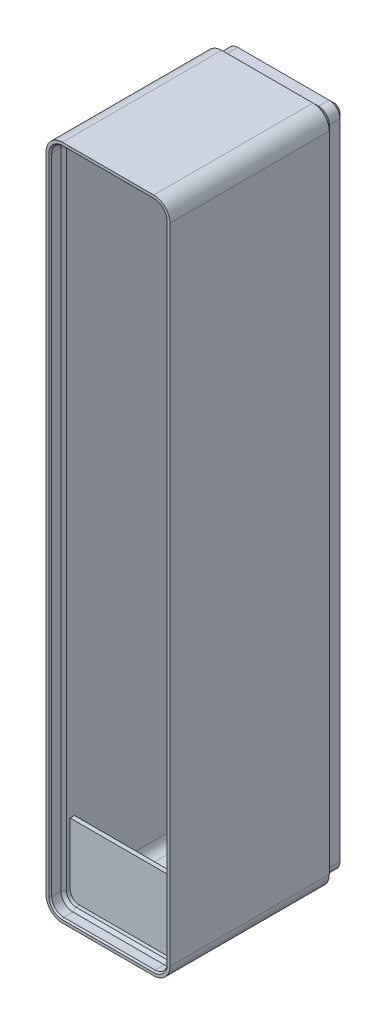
ISO-10303-21;
HEADER;
FILE_DESCRIPTION(('STEP AP214'),'2;1');
FILE_NAME('part.step','',(''),(''),'','','');
FILE_SCHEMA(('AUTOMOTIVE_DESIGN { 1 0 10303 214 1 1 1 1 }'));
ENDSEC;
DATA;
#1=APPLICATION_CONTEXT('core data for automotive mechanical design processes');
#2=APPLICATION_PROTOCOL_DEFINITION('international standard','automotive_design',2000,#1);
#3=PRODUCT_CONTEXT('',#1,'mechanical');
#4=PRODUCT('Part','Part','',(#3));
#5=PRODUCT_RELATED_PRODUCT_CATEGORY('part','',(#4));
#6=PRODUCT_DEFINITION_FORMATION('','',#4);
#7=PRODUCT_DEFINITION_CONTEXT('part definition',#1,'design');
#8=PRODUCT_DEFINITION('design','',#6,#7);
#9=PRODUCT_DEFINITION_SHAPE('','',#8);
#10=(LENGTH_UNIT() NAMED_UNIT(*) SI_UNIT(.MILLI.,.METRE.));
#11=(NAMED_UNIT(*) PLANE_ANGLE_UNIT() SI_UNIT($,.RADIAN.));
#12=(NAMED_UNIT(*) SI_UNIT($,.STERADIAN.) SOLID_ANGLE_UNIT());
#13=UNCERTAINTY_MEASURE_WITH_UNIT(LENGTH_MEASURE(1.E-05),#10,'distance_accuracy_value','');
#14=(GEOMETRIC_REPRESENTATION_CONTEXT(3) GLOBAL_UNCERTAINTY_ASSIGNED_CONTEXT((#13)) GLOBAL_UNIT_ASSIGNED_CONTEXT((#10,
#11,#12)) REPRESENTATION_CONTEXT('',''));
#15=CARTESIAN_POINT('',(0.,0.,0.));
#16=DIRECTION('',(0.,0.,1.));
#17=DIRECTION('',(1.,0.,0.));
#18=AXIS2_PLACEMENT_3D('',#15,#16,#17);
#19=CARTESIAN_POINT('',(-6.44999999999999,-46.75,25.5));
#20=DIRECTION('',(0.,1.,0.));
#21=DIRECTION('',(0.,0.,1.));
#22=AXIS2_PLACEMENT_3D('',#19,#20,#21);
#23=PLANE('',#22);
#24=DIRECTION('',(1.,0.,0.));
#25=VECTOR('',#24,1.);
#26=CARTESIAN_POINT('',(-8.75199999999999,-46.75,23.1));
#27=LINE('',#26,#25);
#28=CARTESIAN_POINT('',(-6.44999999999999,-46.75,23.1));
#29=VERTEX_POINT('',#28);
#30=CARTESIAN_POINT('',(6.45,-46.75,23.1));
#31=VERTEX_POINT('',#30);
#32=EDGE_CURVE('E67',#29,#31,#27,.T.);
#33=ORIENTED_EDGE('',*,*,#32,.F.);
#34=DIRECTION('',(0.,0.,1.));
#35=VECTOR('',#34,1.);
#36=CARTESIAN_POINT('',(-6.44999999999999,-46.75,25.5));
#37=LINE('',#36,#35);
#38=CARTESIAN_POINT('',(-6.44999999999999,-46.75,23.6));
#39=VERTEX_POINT('',#38);
#40=EDGE_CURVE('E900',#39,#29,#37,.F.);
#41=ORIENTED_EDGE('',*,*,#40,.F.);
#42=DIRECTION('',(-1.,0.,0.));
#43=VECTOR('',#42,1.);
#44=CARTESIAN_POINT('',(-6.44999999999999,-46.75,23.6));
#45=LINE('',#44,#43);
#46=CARTESIAN_POINT('',(6.45,-46.75,23.6));
#47=VERTEX_POINT('',#46);
#48=EDGE_CURVE('E11',#47,#39,#45,.T.);
#49=ORIENTED_EDGE('',*,*,#48,.F.);
#50=DIRECTION('',(0.,0.,-1.));
#51=VECTOR('',#50,1.);
#52=CARTESIAN_POINT('',(6.45,-46.75,25.5));
#53=LINE('',#52,#51);
#54=EDGE_CURVE('E422',#47,#31,#53,.T.);
#55=ORIENTED_EDGE('',*,*,#54,.T.);
#56=EDGE_LOOP('',(#33,#41,#49,#55));
#57=FACE_BOUND('',#56,.T.);
#58=ADVANCED_FACE('F43',(#57),#23,.T.);
#59=CARTESIAN_POINT('',(-6.44999999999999,-45.45,25.5));
#60=DIRECTION('',(0.,0.,-1.));
#61=DIRECTION('',(-1.,0.,0.));
#62=AXIS2_PLACEMENT_3D('',#59,#60,#61);
#63=CYLINDRICAL_SURFACE('',#62,1.3);
#64=CARTESIAN_POINT('',(-6.44999999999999,-45.45,23.1));
#65=DIRECTION('',(0.,0.,1.));
#66=DIRECTION('',(1.,0.,0.));
#67=AXIS2_PLACEMENT_3D('',#64,#65,#66);
#68=CIRCLE('',#67,1.3);
#69=CARTESIAN_POINT('',(-7.74999999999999,-45.45,23.1));
#70=VERTEX_POINT('',#69);
#71=EDGE_CURVE('E459',#29,#70,#68,.F.);
#72=ORIENTED_EDGE('',*,*,#71,.T.);
#73=DIRECTION('',(0.,0.,-1.));
#74=VECTOR('',#73,1.);
#75=CARTESIAN_POINT('',(-7.74999999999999,-45.45,25.5));
#76=LINE('',#75,#74);
#77=CARTESIAN_POINT('',(-7.75,-45.45,23.6));
#78=VERTEX_POINT('',#77);
#79=EDGE_CURVE('E895',#78,#70,#76,.T.);
#80=ORIENTED_EDGE('',*,*,#79,.F.);
#81=CARTESIAN_POINT('',(-6.44999999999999,-45.45,23.6));
#82=DIRECTION('',(0.,0.,1.));
#83=DIRECTION('',(1.,0.,0.));
#84=AXIS2_PLACEMENT_3D('',#81,#82,#83);
#85=CIRCLE('',#84,1.3);
#86=EDGE_CURVE('E476',#39,#78,#85,.F.);
#87=ORIENTED_EDGE('',*,*,#86,.F.);
#88=ORIENTED_EDGE('',*,*,#40,.T.);
#89=EDGE_LOOP('',(#72,#80,#87,#88));
#90=FACE_BOUND('',#89,.T.);
#91=ADVANCED_FACE('F1282',(#90),#63,.F.);
#92=CARTESIAN_POINT('',(6.45000000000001,-45.45,25.5));
#93=DIRECTION('',(0.,0.,-1.));
#94=DIRECTION('',(-1.,0.,0.));
#95=AXIS2_PLACEMENT_3D('',#92,#93,#94);
#96=CYLINDRICAL_SURFACE('',#95,1.3);
#97=CARTESIAN_POINT('',(6.45000000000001,-45.45,23.1));
#98=DIRECTION('',(0.,0.,-1.));
#99=DIRECTION('',(-1.,0.,0.));
#100=AXIS2_PLACEMENT_3D('',#97,#98,#99);
#101=CIRCLE('',#100,1.3);
#102=CARTESIAN_POINT('',(7.75000000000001,-45.45,23.1));
#103=VERTEX_POINT('',#102);
#104=EDGE_CURVE('E1348',#31,#103,#101,.F.);
#105=ORIENTED_EDGE('',*,*,#104,.F.);
#106=ORIENTED_EDGE('',*,*,#54,.F.);
#107=CARTESIAN_POINT('',(6.45000000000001,-45.45,23.6));
#108=DIRECTION('',(0.,0.,1.));
#109=DIRECTION('',(1.,0.,0.));
#110=AXIS2_PLACEMENT_3D('',#107,#108,#109);
#111=CIRCLE('',#110,1.3);
#112=CARTESIAN_POINT('',(7.75000000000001,-45.45,23.6));
#113=VERTEX_POINT('',#112);
#114=EDGE_CURVE('E500',#113,#47,#111,.F.);
#115=ORIENTED_EDGE('',*,*,#114,.F.);
#116=DIRECTION('',(0.,0.,1.));
#117=VECTOR('',#116,1.);
#118=CARTESIAN_POINT('',(7.75000000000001,-45.45,25.5));
#119=LINE('',#118,#117);
#120=EDGE_CURVE('E823',#113,#103,#119,.F.);
#121=ORIENTED_EDGE('',*,*,#120,.T.);
#122=EDGE_LOOP('',(#105,#106,#115,#121));
#123=FACE_BOUND('',#122,.T.);
#124=ADVANCED_FACE('F1288',(#123),#96,.F.);
#125=CARTESIAN_POINT('',(6.45000000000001,-45.45,0.));
#126=DIRECTION('',(0.,0.,1.));
#127=DIRECTION('',(1.,0.,0.));
#128=AXIS2_PLACEMENT_3D('',#125,#126,#127);
#129=CONICAL_SURFACE('',#128,0.800000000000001,0.78539816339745);
#130=CARTESIAN_POINT('',(6.45000000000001,-45.45,0.));
#131=DIRECTION('',(0.,0.,1.));
#132=DIRECTION('',(1.,0.,0.));
#133=AXIS2_PLACEMENT_3D('',#130,#131,#132);
#134=CIRCLE('',#133,0.800000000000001);
#135=CARTESIAN_POINT('',(6.45,-46.25,0.));
#136=VERTEX_POINT('',#135);
#137=CARTESIAN_POINT('',(7.25000000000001,-45.45,0.));
#138=VERTEX_POINT('',#137);
#139=EDGE_CURVE('E1087',#136,#138,#134,.T.);
#140=ORIENTED_EDGE('',*,*,#139,.T.);
#141=DIRECTION('',(0.707106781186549,0.,0.707106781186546));
#142=VECTOR('',#141,1.);
#143=CARTESIAN_POINT('',(7.25000000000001,-45.45,0.));
#144=LINE('',#143,#142);
#145=CARTESIAN_POINT('',(7.95000000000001,-45.45,0.7));
#146=VERTEX_POINT('',#145);
#147=EDGE_CURVE('E52',#146,#138,#144,.F.);
#148=ORIENTED_EDGE('',*,*,#147,.F.);
#149=CARTESIAN_POINT('',(6.45000000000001,-45.45,0.7));
#150=DIRECTION('',(0.,0.,1.));
#151=DIRECTION('',(1.,0.,0.));
#152=AXIS2_PLACEMENT_3D('',#149,#150,#151);
#153=CIRCLE('',#152,1.5);
#154=CARTESIAN_POINT('',(6.45,-46.95,0.7));
#155=VERTEX_POINT('',#154);
#156=EDGE_CURVE('E1112',#155,#146,#153,.T.);
#157=ORIENTED_EDGE('',*,*,#156,.F.);
#158=DIRECTION('',(0.,-0.707106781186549,0.707106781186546));
#159=VECTOR('',#158,1.);
#160=CARTESIAN_POINT('',(6.45,-46.25,0.));
#161=LINE('',#160,#159);
#162=EDGE_CURVE('E1144',#155,#136,#161,.F.);
#163=ORIENTED_EDGE('',*,*,#162,.T.);
#164=EDGE_LOOP('',(#140,#148,#157,#163));
#165=FACE_BOUND('',#164,.T.);
#166=ADVANCED_FACE('F1266',(#165),#129,.T.);
#167=CARTESIAN_POINT('',(7.25,45.45,0.));
#168=DIRECTION('',(0.707106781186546,0.,-0.707106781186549));
#169=DIRECTION('',(-0.707106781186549,0.,-0.707106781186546));
#170=AXIS2_PLACEMENT_3D('',#167,#168,#169);
#171=PLANE('',#170);
#172=DIRECTION('',(0.,1.,0.));
#173=VECTOR('',#172,1.);
#174=CARTESIAN_POINT('',(7.25,45.45,0.));
#175=LINE('',#174,#173);
#176=CARTESIAN_POINT('',(7.25,45.45,0.));
#177=VERTEX_POINT('',#176);
#178=EDGE_CURVE('E1091',#138,#177,#175,.T.);
#179=ORIENTED_EDGE('',*,*,#178,.T.);
#180=DIRECTION('',(0.707106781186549,0.,0.707106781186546));
#181=VECTOR('',#180,1.);
#182=CARTESIAN_POINT('',(7.25,45.45,0.));
#183=LINE('',#182,#181);
#184=CARTESIAN_POINT('',(7.95,45.45,0.7));
#185=VERTEX_POINT('',#184);
#186=EDGE_CURVE('E1148',#185,#177,#183,.F.);
#187=ORIENTED_EDGE('',*,*,#186,.F.);
#188=DIRECTION('',(0.,-1.,0.));
#189=VECTOR('',#188,1.);
#190=CARTESIAN_POINT('',(7.95,45.45,0.7));
#191=LINE('',#190,#189);
#192=EDGE_CURVE('E1116',#146,#185,#191,.F.);
#193=ORIENTED_EDGE('',*,*,#192,.F.);
#194=ORIENTED_EDGE('',*,*,#147,.T.);
#195=EDGE_LOOP('',(#179,#187,#193,#194));
#196=FACE_BOUND('',#195,.T.);
#197=ADVANCED_FACE('F45',(#196),#171,.T.);
#198=CARTESIAN_POINT('',(6.45,45.45,0.));
#199=DIRECTION('',(0.,0.,1.));
#200=DIRECTION('',(-1.,0.,0.));
#201=AXIS2_PLACEMENT_3D('',#198,#199,#200);
#202=CONICAL_SURFACE('',#201,0.800000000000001,0.78539816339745);
#203=CARTESIAN_POINT('',(6.45,45.45,0.));
#204=DIRECTION('',(0.,0.,1.));
#205=DIRECTION('',(-1.,0.,0.));
#206=AXIS2_PLACEMENT_3D('',#203,#204,#205);
#207=CIRCLE('',#206,0.800000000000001);
#208=CARTESIAN_POINT('',(6.44999999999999,46.25,0.));
#209=VERTEX_POINT('',#208);
#210=EDGE_CURVE('E1094',#177,#209,#207,.T.);
#211=ORIENTED_EDGE('',*,*,#210,.T.);
#212=DIRECTION('',(0.,0.707106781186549,0.707106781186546));
#213=VECTOR('',#212,1.);
#214=CARTESIAN_POINT('',(6.44999999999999,46.25,0.));
#215=LINE('',#214,#213);
#216=CARTESIAN_POINT('',(6.44999999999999,46.95,0.7));
#217=VERTEX_POINT('',#216);
#218=EDGE_CURVE('E1168',#217,#209,#215,.F.);
#219=ORIENTED_EDGE('',*,*,#218,.F.);
#220=CARTESIAN_POINT('',(6.45,45.45,0.7));
#221=DIRECTION('',(0.,0.,1.));
#222=DIRECTION('',(1.,0.,0.));
#223=AXIS2_PLACEMENT_3D('',#220,#221,#222);
#224=CIRCLE('',#223,1.5);
#225=EDGE_CURVE('E1120',#185,#217,#224,.T.);
#226=ORIENTED_EDGE('',*,*,#225,.F.);
#227=ORIENTED_EDGE('',*,*,#186,.T.);
#228=EDGE_LOOP('',(#211,#219,#226,#227));
#229=FACE_BOUND('',#228,.T.);
#230=ADVANCED_FACE('F1176',(#229),#202,.T.);
#231=CARTESIAN_POINT('',(-6.45,46.25,0.));
#232=DIRECTION('',(0.,0.707106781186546,-0.707106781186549));
#233=DIRECTION('',(0.,0.707106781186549,0.707106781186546));
#234=AXIS2_PLACEMENT_3D('',#231,#232,#233);
#235=PLANE('',#234);
#236=DIRECTION('',(-1.,0.,0.));
#237=VECTOR('',#236,1.);
#238=CARTESIAN_POINT('',(-6.45,46.25,0.));
#239=LINE('',#238,#237);
#240=CARTESIAN_POINT('',(-6.45,46.25,0.));
#241=VERTEX_POINT('',#240);
#242=EDGE_CURVE('E1097',#209,#241,#239,.T.);
#243=ORIENTED_EDGE('',*,*,#242,.T.);
#244=DIRECTION('',(0.,0.707106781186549,0.707106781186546));
#245=VECTOR('',#244,1.);
#246=CARTESIAN_POINT('',(-6.45,46.25,0.));
#247=LINE('',#246,#245);
#248=CARTESIAN_POINT('',(-6.44999999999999,46.95,0.7));
#249=VERTEX_POINT('',#248);
#250=EDGE_CURVE('E1164',#249,#241,#247,.F.);
#251=ORIENTED_EDGE('',*,*,#250,.F.);
#252=DIRECTION('',(1.,0.,0.));
#253=VECTOR('',#252,1.);
#254=CARTESIAN_POINT('',(-6.45,46.95,0.7));
#255=LINE('',#254,#253);
#256=EDGE_CURVE('E1124',#217,#249,#255,.F.);
#257=ORIENTED_EDGE('',*,*,#256,.F.);
#258=ORIENTED_EDGE('',*,*,#218,.T.);
#259=EDGE_LOOP('',(#243,#251,#257,#258));
#260=FACE_BOUND('',#259,.T.);
#261=ADVANCED_FACE('F1185',(#260),#235,.T.);
#262=CARTESIAN_POINT('',(-6.45,45.45,0.));
#263=DIRECTION('',(0.,0.,1.));
#264=DIRECTION('',(1.,0.,0.));
#265=AXIS2_PLACEMENT_3D('',#262,#263,#264);
#266=CONICAL_SURFACE('',#265,0.800000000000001,0.78539816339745);
#267=CARTESIAN_POINT('',(-6.45,45.45,0.));
#268=DIRECTION('',(0.,0.,1.));
#269=DIRECTION('',(1.,0.,0.));
#270=AXIS2_PLACEMENT_3D('',#267,#268,#269);
#271=CIRCLE('',#270,0.800000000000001);
#272=CARTESIAN_POINT('',(-7.25,45.45,0.));
#273=VERTEX_POINT('',#272);
#274=EDGE_CURVE('E1100',#241,#273,#271,.T.);
#275=ORIENTED_EDGE('',*,*,#274,.T.);
#276=DIRECTION('',(-0.707106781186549,0.,0.707106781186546));
#277=VECTOR('',#276,1.);
#278=CARTESIAN_POINT('',(-7.25,45.45,0.));
#279=LINE('',#278,#277);
#280=CARTESIAN_POINT('',(-7.95,45.45,0.7));
#281=VERTEX_POINT('',#280);
#282=EDGE_CURVE('E1160',#281,#273,#279,.F.);
#283=ORIENTED_EDGE('',*,*,#282,.F.);
#284=CARTESIAN_POINT('',(-6.45,45.45,0.7));
#285=DIRECTION('',(0.,0.,1.));
#286=DIRECTION('',(1.,0.,0.));
#287=AXIS2_PLACEMENT_3D('',#284,#285,#286);
#288=CIRCLE('',#287,1.5);
#289=EDGE_CURVE('E1128',#249,#281,#288,.T.);
#290=ORIENTED_EDGE('',*,*,#289,.F.);
#291=ORIENTED_EDGE('',*,*,#250,.T.);
#292=EDGE_LOOP('',(#275,#283,#290,#291));
#293=FACE_BOUND('',#292,.T.);
#294=ADVANCED_FACE('F1189',(#293),#266,.T.);
#295=CARTESIAN_POINT('',(-7.25,45.45,0.));
#296=DIRECTION('',(-0.707106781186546,0.,-0.707106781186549));
#297=DIRECTION('',(-0.707106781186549,0.,0.707106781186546));
#298=AXIS2_PLACEMENT_3D('',#295,#296,#297);
#299=PLANE('',#298);
#300=DIRECTION('',(0.,-1.,0.));
#301=VECTOR('',#300,1.);
#302=CARTESIAN_POINT('',(-7.25,45.45,0.));
#303=LINE('',#302,#301);
#304=CARTESIAN_POINT('',(-7.24999999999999,-45.45,0.));
#305=VERTEX_POINT('',#304);
#306=EDGE_CURVE('E1103',#273,#305,#303,.T.);
#307=ORIENTED_EDGE('',*,*,#306,.T.);
#308=DIRECTION('',(-0.707106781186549,0.,0.707106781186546));
#309=VECTOR('',#308,1.);
#310=CARTESIAN_POINT('',(-7.24999999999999,-45.45,0.));
#311=LINE('',#310,#309);
#312=CARTESIAN_POINT('',(-7.94999999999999,-45.45,0.7));
#313=VERTEX_POINT('',#312);
#314=EDGE_CURVE('E1156',#313,#305,#311,.F.);
#315=ORIENTED_EDGE('',*,*,#314,.F.);
#316=DIRECTION('',(0.,1.,0.));
#317=VECTOR('',#316,1.);
#318=CARTESIAN_POINT('',(-7.95,45.45,0.7));
#319=LINE('',#318,#317);
#320=EDGE_CURVE('E1132',#281,#313,#319,.F.);
#321=ORIENTED_EDGE('',*,*,#320,.F.);
#322=ORIENTED_EDGE('',*,*,#282,.T.);
#323=EDGE_LOOP('',(#307,#315,#321,#322));
#324=FACE_BOUND('',#323,.T.);
#325=ADVANCED_FACE('F1255',(#324),#299,.T.);
#326=CARTESIAN_POINT('',(-6.44999999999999,-45.45,0.));
#327=DIRECTION('',(0.,0.,1.));
#328=DIRECTION('',(1.,0.,0.));
#329=AXIS2_PLACEMENT_3D('',#326,#327,#328);
#330=CONICAL_SURFACE('',#329,0.800000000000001,0.78539816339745);
#331=CARTESIAN_POINT('',(-6.44999999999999,-45.45,0.));
#332=DIRECTION('',(0.,0.,1.));
#333=DIRECTION('',(1.,0.,0.));
#334=AXIS2_PLACEMENT_3D('',#331,#332,#333);
#335=CIRCLE('',#334,0.800000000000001);
#336=CARTESIAN_POINT('',(-6.44999999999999,-46.25,0.));
#337=VERTEX_POINT('',#336);
#338=EDGE_CURVE('E1106',#305,#337,#335,.T.);
#339=ORIENTED_EDGE('',*,*,#338,.T.);
#340=DIRECTION('',(0.,-0.707106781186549,0.707106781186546));
#341=VECTOR('',#340,1.);
#342=CARTESIAN_POINT('',(-6.44999999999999,-46.25,0.));
#343=LINE('',#342,#341);
#344=CARTESIAN_POINT('',(-6.44999999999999,-46.95,0.7));
#345=VERTEX_POINT('',#344);
#346=EDGE_CURVE('E1152',#345,#337,#343,.F.);
#347=ORIENTED_EDGE('',*,*,#346,.F.);
#348=CARTESIAN_POINT('',(-6.44999999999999,-45.45,0.7));
#349=DIRECTION('',(0.,0.,1.));
#350=DIRECTION('',(1.,0.,0.));
#351=AXIS2_PLACEMENT_3D('',#348,#349,#350);
#352=CIRCLE('',#351,1.5);
#353=EDGE_CURVE('E1136',#313,#345,#352,.T.);
#354=ORIENTED_EDGE('',*,*,#353,.F.);
#355=ORIENTED_EDGE('',*,*,#314,.T.);
#356=EDGE_LOOP('',(#339,#347,#354,#355));
#357=FACE_BOUND('',#356,.T.);
#358=ADVANCED_FACE('F1259',(#357),#330,.T.);
#359=CARTESIAN_POINT('',(-6.44999999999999,-46.25,0.));
#360=DIRECTION('',(0.,-0.707106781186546,-0.707106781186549));
#361=DIRECTION('',(0.,0.707106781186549,-0.707106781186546));
#362=AXIS2_PLACEMENT_3D('',#359,#360,#361);
#363=PLANE('',#362);
#364=DIRECTION('',(1.,0.,0.));
#365=VECTOR('',#364,1.);
#366=CARTESIAN_POINT('',(-6.44999999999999,-46.25,0.));
#367=LINE('',#366,#365);
#368=EDGE_CURVE('E1109',#337,#136,#367,.T.);
#369=ORIENTED_EDGE('',*,*,#368,.T.);
#370=ORIENTED_EDGE('',*,*,#162,.F.);
#371=DIRECTION('',(-1.,0.,0.));
#372=VECTOR('',#371,1.);
#373=CARTESIAN_POINT('',(-6.44999999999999,-46.95,0.7));
#374=LINE('',#373,#372);
#375=EDGE_CURVE('E1140',#345,#155,#374,.F.);
#376=ORIENTED_EDGE('',*,*,#375,.F.);
#377=ORIENTED_EDGE('',*,*,#346,.T.);
#378=EDGE_LOOP('',(#369,#370,#376,#377));
#379=FACE_BOUND('',#378,.T.);
#380=ADVANCED_FACE('F1264',(#379),#363,.T.);
#381=CARTESIAN_POINT('',(6.45000000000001,-45.45,0.));
#382=DIRECTION('',(0.,0.,1.));
#383=DIRECTION('',(1.,0.,0.));
#384=AXIS2_PLACEMENT_3D('',#381,#382,#383);
#385=PLANE('',#384);
#386=ORIENTED_EDGE('',*,*,#139,.F.);
#387=ORIENTED_EDGE('',*,*,#368,.F.);
#388=ORIENTED_EDGE('',*,*,#338,.F.);
#389=ORIENTED_EDGE('',*,*,#306,.F.);
#390=ORIENTED_EDGE('',*,*,#274,.F.);
#391=ORIENTED_EDGE('',*,*,#242,.F.);
#392=ORIENTED_EDGE('',*,*,#210,.F.);
#393=ORIENTED_EDGE('',*,*,#178,.F.);
#394=EDGE_LOOP('',(#386,#387,#388,#389,#390,#391,#392,#393));
#395=FACE_BOUND('',#394,.T.);
#396=ADVANCED_FACE('F1181',(#395),#385,.F.);
#397=CARTESIAN_POINT('',(6.45,45.45,2.2));
#398=DIRECTION('',(0.,0.,-1.));
#399=DIRECTION('',(-1.,0.,0.));
#400=AXIS2_PLACEMENT_3D('',#397,#398,#399);
#401=CYLINDRICAL_SURFACE('',#400,1.5);
#402=ORIENTED_EDGE('',*,*,#225,.T.);
#403=DIRECTION('',(0.,0.,-1.));
#404=VECTOR('',#403,1.);
#405=CARTESIAN_POINT('',(6.44999999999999,46.95,2.2));
#406=LINE('',#405,#404);
#407=CARTESIAN_POINT('',(6.44999999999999,46.95,2.2));
#408=VERTEX_POINT('',#407);
#409=EDGE_CURVE('E1083',#408,#217,#406,.T.);
#410=ORIENTED_EDGE('',*,*,#409,.F.);
#411=CARTESIAN_POINT('',(6.45,45.45,2.2));
#412=DIRECTION('',(0.,0.,1.));
#413=DIRECTION('',(1.,0.,0.));
#414=AXIS2_PLACEMENT_3D('',#411,#412,#413);
#415=CIRCLE('',#414,1.5);
#416=CARTESIAN_POINT('',(7.95,45.45,2.2));
#417=VERTEX_POINT('',#416);
#418=EDGE_CURVE('E996',#417,#408,#415,.T.);
#419=ORIENTED_EDGE('',*,*,#418,.F.);
#420=DIRECTION('',(0.,0.,-1.));
#421=VECTOR('',#420,1.);
#422=CARTESIAN_POINT('',(7.95,45.45,2.2));
#423=LINE('',#422,#421);
#424=EDGE_CURVE('E1055',#417,#185,#423,.T.);
#425=ORIENTED_EDGE('',*,*,#424,.T.);
#426=EDGE_LOOP('',(#402,#410,#419,#425));
#427=FACE_BOUND('',#426,.T.);
#428=ADVANCED_FACE('F1272',(#427),#401,.T.);
#429=CARTESIAN_POINT('',(6.44999999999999,46.95,2.2));
#430=DIRECTION('',(0.,-1.,0.));
#431=DIRECTION('',(0.,0.,-1.));
#432=AXIS2_PLACEMENT_3D('',#429,#430,#431);
#433=PLANE('',#432);
#434=ORIENTED_EDGE('',*,*,#256,.T.);
#435=DIRECTION('',(0.,0.,-1.));
#436=VECTOR('',#435,1.);
#437=CARTESIAN_POINT('',(-6.44999999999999,46.95,2.2));
#438=LINE('',#437,#436);
#439=CARTESIAN_POINT('',(-6.44999999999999,46.95,2.2));
#440=VERTEX_POINT('',#439);
#441=EDGE_CURVE('E1079',#440,#249,#438,.T.);
#442=ORIENTED_EDGE('',*,*,#441,.F.);
#443=DIRECTION('',(-1.,0.,0.));
#444=VECTOR('',#443,1.);
#445=CARTESIAN_POINT('',(6.44999999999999,46.95,2.2));
#446=LINE('',#445,#444);
#447=EDGE_CURVE('E1027',#408,#440,#446,.T.);
#448=ORIENTED_EDGE('',*,*,#447,.F.);
#449=ORIENTED_EDGE('',*,*,#409,.T.);
#450=EDGE_LOOP('',(#434,#442,#448,#449));
#451=FACE_BOUND('',#450,.T.);
#452=ADVANCED_FACE('F1193',(#451),#433,.F.);
#453=CARTESIAN_POINT('',(-6.45,45.45,2.2));
#454=DIRECTION('',(0.,0.,-1.));
#455=DIRECTION('',(-1.,0.,0.));
#456=AXIS2_PLACEMENT_3D('',#453,#454,#455);
#457=CYLINDRICAL_SURFACE('',#456,1.5);
#458=ORIENTED_EDGE('',*,*,#289,.T.);
#459=DIRECTION('',(0.,0.,-1.));
#460=VECTOR('',#459,1.);
#461=CARTESIAN_POINT('',(-7.95,45.45,2.2));
#462=LINE('',#461,#460);
#463=CARTESIAN_POINT('',(-7.95,45.45,2.2));
#464=VERTEX_POINT('',#463);
#465=EDGE_CURVE('E1075',#464,#281,#462,.T.);
#466=ORIENTED_EDGE('',*,*,#465,.F.);
#467=CARTESIAN_POINT('',(-6.45,45.45,2.2));
#468=DIRECTION('',(0.,0.,1.));
#469=DIRECTION('',(1.,0.,0.));
#470=AXIS2_PLACEMENT_3D('',#467,#468,#469);
#471=CIRCLE('',#470,1.5);
#472=EDGE_CURVE('E1031',#440,#464,#471,.T.);
#473=ORIENTED_EDGE('',*,*,#472,.F.);
#474=ORIENTED_EDGE('',*,*,#441,.T.);
#475=EDGE_LOOP('',(#458,#466,#473,#474));
#476=FACE_BOUND('',#475,.T.);
#477=ADVANCED_FACE('F1196',(#476),#457,.T.);
#478=CARTESIAN_POINT('',(-7.95,45.45,2.2));
#479=DIRECTION('',(1.,0.,0.));
#480=DIRECTION('',(0.,1.,0.));
#481=AXIS2_PLACEMENT_3D('',#478,#479,#480);
#482=PLANE('',#481);
#483=ORIENTED_EDGE('',*,*,#320,.T.);
#484=DIRECTION('',(0.,0.,-1.));
#485=VECTOR('',#484,1.);
#486=CARTESIAN_POINT('',(-7.94999999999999,-45.45,2.2));
#487=LINE('',#486,#485);
#488=CARTESIAN_POINT('',(-7.94999999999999,-45.45,2.2));
#489=VERTEX_POINT('',#488);
#490=EDGE_CURVE('E1071',#489,#313,#487,.T.);
#491=ORIENTED_EDGE('',*,*,#490,.F.);
#492=DIRECTION('',(0.,-1.,0.));
#493=VECTOR('',#492,1.);
#494=CARTESIAN_POINT('',(-7.95,45.45,2.2));
#495=LINE('',#494,#493);
#496=EDGE_CURVE('E1035',#464,#489,#495,.T.);
#497=ORIENTED_EDGE('',*,*,#496,.F.);
#498=ORIENTED_EDGE('',*,*,#465,.T.);
#499=EDGE_LOOP('',(#483,#491,#497,#498));
#500=FACE_BOUND('',#499,.T.);
#501=ADVANCED_FACE('F1253',(#500),#482,.F.);
#502=CARTESIAN_POINT('',(-6.44999999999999,-45.45,2.2));
#503=DIRECTION('',(0.,0.,-1.));
#504=DIRECTION('',(-1.,0.,0.));
#505=AXIS2_PLACEMENT_3D('',#502,#503,#504);
#506=CYLINDRICAL_SURFACE('',#505,1.5);
#507=ORIENTED_EDGE('',*,*,#353,.T.);
#508=DIRECTION('',(0.,0.,-1.));
#509=VECTOR('',#508,1.);
#510=CARTESIAN_POINT('',(-6.44999999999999,-46.95,2.2));
#511=LINE('',#510,#509);
#512=CARTESIAN_POINT('',(-6.44999999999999,-46.95,2.2));
#513=VERTEX_POINT('',#512);
#514=EDGE_CURVE('E1067',#513,#345,#511,.T.);
#515=ORIENTED_EDGE('',*,*,#514,.F.);
#516=CARTESIAN_POINT('',(-6.44999999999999,-45.45,2.2));
#517=DIRECTION('',(0.,0.,1.));
#518=DIRECTION('',(1.,0.,0.));
#519=AXIS2_PLACEMENT_3D('',#516,#517,#518);
#520=CIRCLE('',#519,1.5);
#521=EDGE_CURVE('E1039',#489,#513,#520,.T.);
#522=ORIENTED_EDGE('',*,*,#521,.F.);
#523=ORIENTED_EDGE('',*,*,#490,.T.);
#524=EDGE_LOOP('',(#507,#515,#522,#523));
#525=FACE_BOUND('',#524,.T.);
#526=ADVANCED_FACE('F1249',(#525),#506,.T.);
#527=CARTESIAN_POINT('',(-6.44999999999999,-46.95,2.2));
#528=DIRECTION('',(0.,1.,0.));
#529=DIRECTION('',(0.,0.,1.));
#530=AXIS2_PLACEMENT_3D('',#527,#528,#529);
#531=PLANE('',#530);
#532=ORIENTED_EDGE('',*,*,#375,.T.);
#533=DIRECTION('',(0.,0.,-1.));
#534=VECTOR('',#533,1.);
#535=CARTESIAN_POINT('',(6.45,-46.95,2.2));
#536=LINE('',#535,#534);
#537=CARTESIAN_POINT('',(6.45,-46.95,2.2));
#538=VERTEX_POINT('',#537);
#539=EDGE_CURVE('E1063',#538,#155,#536,.T.);
#540=ORIENTED_EDGE('',*,*,#539,.F.);
#541=DIRECTION('',(1.,0.,0.));
#542=VECTOR('',#541,1.);
#543=CARTESIAN_POINT('',(-6.44999999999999,-46.95,2.2));
#544=LINE('',#543,#542);
#545=EDGE_CURVE('E1043',#513,#538,#544,.T.);
#546=ORIENTED_EDGE('',*,*,#545,.F.);
#547=ORIENTED_EDGE('',*,*,#514,.T.);
#548=EDGE_LOOP('',(#532,#540,#546,#547));
#549=FACE_BOUND('',#548,.T.);
#550=ADVANCED_FACE('F1243',(#549),#531,.F.);
#551=CARTESIAN_POINT('',(6.45000000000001,-45.45,2.2));
#552=DIRECTION('',(0.,0.,-1.));
#553=DIRECTION('',(-1.,0.,0.));
#554=AXIS2_PLACEMENT_3D('',#551,#552,#553);
#555=CYLINDRICAL_SURFACE('',#554,1.5);
#556=ORIENTED_EDGE('',*,*,#156,.T.);
#557=DIRECTION('',(0.,0.,-1.));
#558=VECTOR('',#557,1.);
#559=CARTESIAN_POINT('',(7.95000000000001,-45.45,2.2));
#560=LINE('',#559,#558);
#561=CARTESIAN_POINT('',(7.95000000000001,-45.45,2.2));
#562=VERTEX_POINT('',#561);
#563=EDGE_CURVE('E1059',#562,#146,#560,.T.);
#564=ORIENTED_EDGE('',*,*,#563,.F.);
#565=CARTESIAN_POINT('',(6.45000000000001,-45.45,2.2));
#566=DIRECTION('',(0.,0.,1.));
#567=DIRECTION('',(1.,0.,0.));
#568=AXIS2_PLACEMENT_3D('',#565,#566,#567);
#569=CIRCLE('',#568,1.5);
#570=EDGE_CURVE('E1047',#538,#562,#569,.T.);
#571=ORIENTED_EDGE('',*,*,#570,.F.);
#572=ORIENTED_EDGE('',*,*,#539,.T.);
#573=EDGE_LOOP('',(#556,#564,#571,#572));
#574=FACE_BOUND('',#573,.T.);
#575=ADVANCED_FACE('F1236',(#574),#555,.T.);
#576=CARTESIAN_POINT('',(7.95000000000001,-45.45,2.2));
#577=DIRECTION('',(-1.,0.,0.));
#578=DIRECTION('',(0.,-1.,0.));
#579=AXIS2_PLACEMENT_3D('',#576,#577,#578);
#580=PLANE('',#579);
#581=ORIENTED_EDGE('',*,*,#192,.T.);
#582=ORIENTED_EDGE('',*,*,#424,.F.);
#583=DIRECTION('',(0.,1.,0.));
#584=VECTOR('',#583,1.);
#585=CARTESIAN_POINT('',(7.95000000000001,-45.45,2.2));
#586=LINE('',#585,#584);
#587=EDGE_CURVE('E1051',#562,#417,#586,.T.);
#588=ORIENTED_EDGE('',*,*,#587,.F.);
#589=ORIENTED_EDGE('',*,*,#563,.T.);
#590=EDGE_LOOP('',(#581,#582,#588,#589));
#591=FACE_BOUND('',#590,.T.);
#592=ADVANCED_FACE('F1269',(#591),#580,.F.);
#593=CARTESIAN_POINT('',(6.45000000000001,-45.45,2.2));
#594=DIRECTION('',(0.,0.,1.));
#595=DIRECTION('',(1.,0.,0.));
#596=AXIS2_PLACEMENT_3D('',#593,#594,#595);
#597=CONICAL_SURFACE('',#596,1.5,0.78539816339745);
#598=ORIENTED_EDGE('',*,*,#570,.T.);
#599=DIRECTION('',(0.707106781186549,0.,0.707106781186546));
#600=VECTOR('',#599,1.);
#601=CARTESIAN_POINT('',(7.95000000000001,-45.45,2.2));
#602=LINE('',#601,#600);
#603=CARTESIAN_POINT('',(8.75000000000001,-45.45,3.));
#604=VERTEX_POINT('',#603);
#605=EDGE_CURVE('E992',#604,#562,#602,.F.);
#606=ORIENTED_EDGE('',*,*,#605,.F.);
#607=CARTESIAN_POINT('',(6.45000000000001,-45.45,3.));
#608=DIRECTION('',(0.,0.,1.));
#609=DIRECTION('',(1.,0.,0.));
#610=AXIS2_PLACEMENT_3D('',#607,#608,#609);
#611=CIRCLE('',#610,2.3);
#612=CARTESIAN_POINT('',(6.44999999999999,-47.75,3.));
#613=VERTEX_POINT('',#612);
#614=EDGE_CURVE('E959',#613,#604,#611,.T.);
#615=ORIENTED_EDGE('',*,*,#614,.F.);
#616=DIRECTION('',(0.,-0.707106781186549,0.707106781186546));
#617=VECTOR('',#616,1.);
#618=CARTESIAN_POINT('',(6.45,-46.95,2.2));
#619=LINE('',#618,#617);
#620=EDGE_CURVE('E991',#613,#538,#619,.F.);
#621=ORIENTED_EDGE('',*,*,#620,.T.);
#622=EDGE_LOOP('',(#598,#606,#615,#621));
#623=FACE_BOUND('',#622,.T.);
#624=ADVANCED_FACE('F1232',(#623),#597,.T.);
#625=CARTESIAN_POINT('',(7.95000000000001,-45.45,2.2));
#626=DIRECTION('',(0.707106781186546,0.,-0.707106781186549));
#627=DIRECTION('',(-0.707106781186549,0.,-0.707106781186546));
#628=AXIS2_PLACEMENT_3D('',#625,#626,#627);
#629=PLANE('',#628);
#630=ORIENTED_EDGE('',*,*,#587,.T.);
#631=DIRECTION('',(0.707106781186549,0.,0.707106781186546));
#632=VECTOR('',#631,1.);
#633=CARTESIAN_POINT('',(7.95,45.45,2.2));
#634=LINE('',#633,#632);
#635=CARTESIAN_POINT('',(8.75,45.4499999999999,3.));
#636=VERTEX_POINT('',#635);
#637=EDGE_CURVE('E997',#636,#417,#634,.F.);
#638=ORIENTED_EDGE('',*,*,#637,.F.);
#639=DIRECTION('',(0.,-1.,0.));
#640=VECTOR('',#639,1.);
#641=CARTESIAN_POINT('',(8.75000000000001,-45.45,3.));
#642=LINE('',#641,#640);
#643=EDGE_CURVE('E963',#604,#636,#642,.F.);
#644=ORIENTED_EDGE('',*,*,#643,.F.);
#645=ORIENTED_EDGE('',*,*,#605,.T.);
#646=EDGE_LOOP('',(#630,#638,#644,#645));
#647=FACE_BOUND('',#646,.T.);
#648=ADVANCED_FACE('F1230',(#647),#629,.T.);
#649=CARTESIAN_POINT('',(6.45,45.45,2.2));
#650=DIRECTION('',(0.,0.,1.));
#651=DIRECTION('',(1.,0.,0.));
#652=AXIS2_PLACEMENT_3D('',#649,#650,#651);
#653=CONICAL_SURFACE('',#652,1.5,0.78539816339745);
#654=ORIENTED_EDGE('',*,*,#418,.T.);
#655=DIRECTION('',(0.,0.707106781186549,0.707106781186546));
#656=VECTOR('',#655,1.);
#657=CARTESIAN_POINT('',(6.44999999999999,46.95,2.2));
#658=LINE('',#657,#656);
#659=CARTESIAN_POINT('',(6.44999999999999,47.75,3.));
#660=VERTEX_POINT('',#659);
#661=EDGE_CURVE('E1017',#660,#408,#658,.F.);
#662=ORIENTED_EDGE('',*,*,#661,.F.);
#663=CARTESIAN_POINT('',(6.45,45.45,3.));
#664=DIRECTION('',(0.,0.,1.));
#665=DIRECTION('',(1.,0.,0.));
#666=AXIS2_PLACEMENT_3D('',#663,#664,#665);
#667=CIRCLE('',#666,2.30000000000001);
#668=EDGE_CURVE('E967',#636,#660,#667,.T.);
#669=ORIENTED_EDGE('',*,*,#668,.F.);
#670=ORIENTED_EDGE('',*,*,#637,.T.);
#671=EDGE_LOOP('',(#654,#662,#669,#670));
#672=FACE_BOUND('',#671,.T.);
#673=ADVANCED_FACE('F1224',(#672),#653,.T.);
#674=CARTESIAN_POINT('',(6.44999999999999,46.95,2.2));
#675=DIRECTION('',(0.,0.707106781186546,-0.707106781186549));
#676=DIRECTION('',(0.,0.707106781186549,0.707106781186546));
#677=AXIS2_PLACEMENT_3D('',#674,#675,#676);
#678=PLANE('',#677);
#679=ORIENTED_EDGE('',*,*,#447,.T.);
#680=DIRECTION('',(0.,0.707106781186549,0.707106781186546));
#681=VECTOR('',#680,1.);
#682=CARTESIAN_POINT('',(-6.44999999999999,46.95,2.2));
#683=LINE('',#682,#681);
#684=CARTESIAN_POINT('',(-6.44999999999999,47.75,3.));
#685=VERTEX_POINT('',#684);
#686=EDGE_CURVE('E1013',#685,#440,#683,.F.);
#687=ORIENTED_EDGE('',*,*,#686,.F.);
#688=DIRECTION('',(1.,0.,0.));
#689=VECTOR('',#688,1.);
#690=CARTESIAN_POINT('',(6.44999999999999,47.75,3.));
#691=LINE('',#690,#689);
#692=EDGE_CURVE('E971',#660,#685,#691,.F.);
#693=ORIENTED_EDGE('',*,*,#692,.F.);
#694=ORIENTED_EDGE('',*,*,#661,.T.);
#695=EDGE_LOOP('',(#679,#687,#693,#694));
#696=FACE_BOUND('',#695,.T.);
#697=ADVANCED_FACE('F1200',(#696),#678,.T.);
#698=CARTESIAN_POINT('',(-6.45,45.45,2.2));
#699=DIRECTION('',(0.,0.,1.));
#700=DIRECTION('',(1.,0.,0.));
#701=AXIS2_PLACEMENT_3D('',#698,#699,#700);
#702=CONICAL_SURFACE('',#701,1.5,0.78539816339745);
#703=ORIENTED_EDGE('',*,*,#472,.T.);
#704=DIRECTION('',(-0.707106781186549,0.,0.707106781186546));
#705=VECTOR('',#704,1.);
#706=CARTESIAN_POINT('',(-7.95,45.45,2.2));
#707=LINE('',#706,#705);
#708=CARTESIAN_POINT('',(-8.75000000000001,45.45,3.));
#709=VERTEX_POINT('',#708);
#710=EDGE_CURVE('E1009',#709,#464,#707,.F.);
#711=ORIENTED_EDGE('',*,*,#710,.F.);
#712=CARTESIAN_POINT('',(-6.45,45.45,3.));
#713=DIRECTION('',(0.,0.,1.));
#714=DIRECTION('',(1.,0.,0.));
#715=AXIS2_PLACEMENT_3D('',#712,#713,#714);
#716=CIRCLE('',#715,2.3);
#717=EDGE_CURVE('E975',#685,#709,#716,.T.);
#718=ORIENTED_EDGE('',*,*,#717,.F.);
#719=ORIENTED_EDGE('',*,*,#686,.T.);
#720=EDGE_LOOP('',(#703,#711,#718,#719));
#721=FACE_BOUND('',#720,.T.);
#722=ADVANCED_FACE('F1203',(#721),#702,.T.);
#723=CARTESIAN_POINT('',(-7.95,45.45,2.2));
#724=DIRECTION('',(-0.707106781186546,0.,-0.707106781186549));
#725=DIRECTION('',(-0.707106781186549,0.,0.707106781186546));
#726=AXIS2_PLACEMENT_3D('',#723,#724,#725);
#727=PLANE('',#726);
#728=ORIENTED_EDGE('',*,*,#496,.T.);
#729=DIRECTION('',(-0.707106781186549,0.,0.707106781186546));
#730=VECTOR('',#729,1.);
#731=CARTESIAN_POINT('',(-7.94999999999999,-45.45,2.2));
#732=LINE('',#731,#730);
#733=CARTESIAN_POINT('',(-8.75,-45.45,3.));
#734=VERTEX_POINT('',#733);
#735=EDGE_CURVE('E1005',#734,#489,#732,.F.);
#736=ORIENTED_EDGE('',*,*,#735,.F.);
#737=DIRECTION('',(0.,1.,0.));
#738=VECTOR('',#737,1.);
#739=CARTESIAN_POINT('',(-8.75000000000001,45.45,3.));
#740=LINE('',#739,#738);
#741=EDGE_CURVE('E979',#709,#734,#740,.F.);
#742=ORIENTED_EDGE('',*,*,#741,.F.);
#743=ORIENTED_EDGE('',*,*,#710,.T.);
#744=EDGE_LOOP('',(#728,#736,#742,#743));
#745=FACE_BOUND('',#744,.T.);
#746=ADVANCED_FACE('F1251',(#745),#727,.T.);
#747=CARTESIAN_POINT('',(-6.44999999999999,-45.45,2.2));
#748=DIRECTION('',(0.,0.,1.));
#749=DIRECTION('',(1.,0.,0.));
#750=AXIS2_PLACEMENT_3D('',#747,#748,#749);
#751=CONICAL_SURFACE('',#750,1.5,0.78539816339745);
#752=ORIENTED_EDGE('',*,*,#521,.T.);
#753=DIRECTION('',(0.,-0.707106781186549,0.707106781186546));
#754=VECTOR('',#753,1.);
#755=CARTESIAN_POINT('',(-6.44999999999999,-46.95,2.2));
#756=LINE('',#755,#754);
#757=CARTESIAN_POINT('',(-6.44999999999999,-47.75,3.));
#758=VERTEX_POINT('',#757);
#759=EDGE_CURVE('E1001',#758,#513,#756,.F.);
#760=ORIENTED_EDGE('',*,*,#759,.F.);
#761=CARTESIAN_POINT('',(-6.44999999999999,-45.45,3.));
#762=DIRECTION('',(0.,0.,1.));
#763=DIRECTION('',(1.,0.,0.));
#764=AXIS2_PLACEMENT_3D('',#761,#762,#763);
#765=CIRCLE('',#764,2.30000000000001);
#766=EDGE_CURVE('E983',#734,#758,#765,.T.);
#767=ORIENTED_EDGE('',*,*,#766,.F.);
#768=ORIENTED_EDGE('',*,*,#735,.T.);
#769=EDGE_LOOP('',(#752,#760,#767,#768));
#770=FACE_BOUND('',#769,.T.);
#771=ADVANCED_FACE('F1246',(#770),#751,.T.);
#772=CARTESIAN_POINT('',(-6.44999999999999,-46.95,2.2));
#773=DIRECTION('',(0.,-0.707106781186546,-0.707106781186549));
#774=DIRECTION('',(0.,0.707106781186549,-0.707106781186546));
#775=AXIS2_PLACEMENT_3D('',#772,#773,#774);
#776=PLANE('',#775);
#777=ORIENTED_EDGE('',*,*,#545,.T.);
#778=ORIENTED_EDGE('',*,*,#620,.F.);
#779=DIRECTION('',(-1.,0.,0.));
#780=VECTOR('',#779,1.);
#781=CARTESIAN_POINT('',(-6.44999999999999,-47.75,3.));
#782=LINE('',#781,#780);
#783=EDGE_CURVE('E987',#758,#613,#782,.F.);
#784=ORIENTED_EDGE('',*,*,#783,.F.);
#785=ORIENTED_EDGE('',*,*,#759,.T.);
#786=EDGE_LOOP('',(#777,#778,#784,#785));
#787=FACE_BOUND('',#786,.T.);
#788=ADVANCED_FACE('F1240',(#787),#776,.T.);
#789=CARTESIAN_POINT('',(6.45000000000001,-45.45,25.5));
#790=DIRECTION('',(0.,0.,-1.));
#791=DIRECTION('',(-1.,0.,0.));
#792=AXIS2_PLACEMENT_3D('',#789,#790,#791);
#793=CYLINDRICAL_SURFACE('',#792,2.3);
#794=ORIENTED_EDGE('',*,*,#614,.T.);
#795=DIRECTION('',(0.,0.,-1.));
#796=VECTOR('',#795,1.);
#797=CARTESIAN_POINT('',(8.75000000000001,-45.45,25.5));
#798=LINE('',#797,#796);
#799=CARTESIAN_POINT('',(8.75000000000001,-45.45,25.5));
#800=VERTEX_POINT('',#799);
#801=EDGE_CURVE('E955',#800,#604,#798,.T.);
#802=ORIENTED_EDGE('',*,*,#801,.F.);
#803=CARTESIAN_POINT('',(6.45000000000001,-45.45,25.5));
#804=DIRECTION('',(0.,0.,1.));
#805=DIRECTION('',(1.,0.,0.));
#806=AXIS2_PLACEMENT_3D('',#803,#804,#805);
#807=CIRCLE('',#806,2.3);
#808=CARTESIAN_POINT('',(6.44999999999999,-47.75,25.5));
#809=VERTEX_POINT('',#808);
#810=EDGE_CURVE('E671',#809,#800,#807,.T.);
#811=ORIENTED_EDGE('',*,*,#810,.F.);
#812=DIRECTION('',(0.,0.,-1.));
#813=VECTOR('',#812,1.);
#814=CARTESIAN_POINT('',(6.44999999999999,-47.75,25.5));
#815=LINE('',#814,#813);
#816=EDGE_CURVE('E927',#809,#613,#815,.T.);
#817=ORIENTED_EDGE('',*,*,#816,.T.);
#818=EDGE_LOOP('',(#794,#802,#811,#817));
#819=FACE_BOUND('',#818,.T.);
#820=ADVANCED_FACE('F2104',(#819),#793,.T.);
#821=CARTESIAN_POINT('',(8.75000000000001,-45.45,25.5));
#822=DIRECTION('',(-1.,0.,0.));
#823=DIRECTION('',(0.,-1.,0.));
#824=AXIS2_PLACEMENT_3D('',#821,#822,#823);
#825=PLANE('',#824);
#826=ORIENTED_EDGE('',*,*,#643,.T.);
#827=DIRECTION('',(0.,0.,-1.));
#828=VECTOR('',#827,1.);
#829=CARTESIAN_POINT('',(8.75,45.4499999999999,25.5));
#830=LINE('',#829,#828);
#831=CARTESIAN_POINT('',(8.75,45.4499999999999,25.5));
#832=VERTEX_POINT('',#831);
#833=EDGE_CURVE('E951',#832,#636,#830,.T.);
#834=ORIENTED_EDGE('',*,*,#833,.F.);
#835=DIRECTION('',(0.,1.,0.));
#836=VECTOR('',#835,1.);
#837=CARTESIAN_POINT('',(8.75000000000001,-45.45,25.5));
#838=LINE('',#837,#836);
#839=EDGE_CURVE('E906',#800,#832,#838,.T.);
#840=ORIENTED_EDGE('',*,*,#839,.F.);
#841=ORIENTED_EDGE('',*,*,#801,.T.);
#842=EDGE_LOOP('',(#826,#834,#840,#841));
#843=FACE_BOUND('',#842,.T.);
#844=ADVANCED_FACE('F1226',(#843),#825,.F.);
#845=CARTESIAN_POINT('',(6.45,45.45,25.5));
#846=DIRECTION('',(0.,0.,-1.));
#847=DIRECTION('',(-1.,0.,0.));
#848=AXIS2_PLACEMENT_3D('',#845,#846,#847);
#849=CYLINDRICAL_SURFACE('',#848,2.3);
#850=ORIENTED_EDGE('',*,*,#668,.T.);
#851=DIRECTION('',(0.,0.,-1.));
#852=VECTOR('',#851,1.);
#853=CARTESIAN_POINT('',(6.44999999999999,47.75,25.5));
#854=LINE('',#853,#852);
#855=CARTESIAN_POINT('',(6.44999999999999,47.75,25.5));
#856=VERTEX_POINT('',#855);
#857=EDGE_CURVE('E947',#856,#660,#854,.T.);
#858=ORIENTED_EDGE('',*,*,#857,.F.);
#859=CARTESIAN_POINT('',(6.45,45.45,25.5));
#860=DIRECTION('',(0.,0.,1.));
#861=DIRECTION('',(1.,0.,0.));
#862=AXIS2_PLACEMENT_3D('',#859,#860,#861);
#863=CIRCLE('',#862,2.3);
#864=EDGE_CURVE('E909',#832,#856,#863,.T.);
#865=ORIENTED_EDGE('',*,*,#864,.F.);
#866=ORIENTED_EDGE('',*,*,#833,.T.);
#867=EDGE_LOOP('',(#850,#858,#865,#866));
#868=FACE_BOUND('',#867,.T.);
#869=ADVANCED_FACE('F1221',(#868),#849,.T.);
#870=CARTESIAN_POINT('',(6.44999999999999,47.75,25.5));
#871=DIRECTION('',(0.,-1.,0.));
#872=DIRECTION('',(0.,0.,-1.));
#873=AXIS2_PLACEMENT_3D('',#870,#871,#872);
#874=PLANE('',#873);
#875=ORIENTED_EDGE('',*,*,#692,.T.);
#876=DIRECTION('',(0.,0.,-1.));
#877=VECTOR('',#876,1.);
#878=CARTESIAN_POINT('',(-6.44999999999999,47.75,25.5));
#879=LINE('',#878,#877);
#880=CARTESIAN_POINT('',(-6.44999999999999,47.75,25.5));
#881=VERTEX_POINT('',#880);
#882=EDGE_CURVE('E943',#881,#685,#879,.T.);
#883=ORIENTED_EDGE('',*,*,#882,.F.);
#884=DIRECTION('',(-1.,0.,0.));
#885=VECTOR('',#884,1.);
#886=CARTESIAN_POINT('',(6.44999999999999,47.75,25.5));
#887=LINE('',#886,#885);
#888=EDGE_CURVE('E912',#856,#881,#887,.T.);
#889=ORIENTED_EDGE('',*,*,#888,.F.);
#890=ORIENTED_EDGE('',*,*,#857,.T.);
#891=EDGE_LOOP('',(#875,#883,#889,#890));
#892=FACE_BOUND('',#891,.T.);
#893=ADVANCED_FACE('F1209',(#892),#874,.F.);
#894=CARTESIAN_POINT('',(-6.45,45.45,25.5));
#895=DIRECTION('',(0.,0.,-1.));
#896=DIRECTION('',(-1.,0.,0.));
#897=AXIS2_PLACEMENT_3D('',#894,#895,#896);
#898=CYLINDRICAL_SURFACE('',#897,2.3);
#899=ORIENTED_EDGE('',*,*,#717,.T.);
#900=DIRECTION('',(0.,0.,-1.));
#901=VECTOR('',#900,1.);
#902=CARTESIAN_POINT('',(-8.75000000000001,45.45,25.5));
#903=LINE('',#902,#901);
#904=CARTESIAN_POINT('',(-8.75000000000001,45.45,25.5));
#905=VERTEX_POINT('',#904);
#906=EDGE_CURVE('E939',#905,#709,#903,.T.);
#907=ORIENTED_EDGE('',*,*,#906,.F.);
#908=CARTESIAN_POINT('',(-6.45,45.45,25.5));
#909=DIRECTION('',(0.,0.,1.));
#910=DIRECTION('',(1.,0.,0.));
#911=AXIS2_PLACEMENT_3D('',#908,#909,#910);
#912=CIRCLE('',#911,2.3);
#913=EDGE_CURVE('E915',#881,#905,#912,.T.);
#914=ORIENTED_EDGE('',*,*,#913,.F.);
#915=ORIENTED_EDGE('',*,*,#882,.T.);
#916=EDGE_LOOP('',(#899,#907,#914,#915));
#917=FACE_BOUND('',#916,.T.);
#918=ADVANCED_FACE('F1213',(#917),#898,.T.);
#919=CARTESIAN_POINT('',(-8.75000000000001,45.45,25.5));
#920=DIRECTION('',(1.,0.,0.));
#921=DIRECTION('',(0.,1.,0.));
#922=AXIS2_PLACEMENT_3D('',#919,#920,#921);
#923=PLANE('',#922);
#924=ORIENTED_EDGE('',*,*,#741,.T.);
#925=DIRECTION('',(0.,0.,-1.));
#926=VECTOR('',#925,1.);
#927=CARTESIAN_POINT('',(-8.74999999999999,-45.45,25.5));
#928=LINE('',#927,#926);
#929=CARTESIAN_POINT('',(-8.74999999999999,-45.45,25.5));
#930=VERTEX_POINT('',#929);
#931=EDGE_CURVE('E935',#930,#734,#928,.T.);
#932=ORIENTED_EDGE('',*,*,#931,.F.);
#933=DIRECTION('',(0.,-1.,0.));
#934=VECTOR('',#933,1.);
#935=CARTESIAN_POINT('',(-8.75000000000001,45.45,25.5));
#936=LINE('',#935,#934);
#937=EDGE_CURVE('E918',#905,#930,#936,.T.);
#938=ORIENTED_EDGE('',*,*,#937,.F.);
#939=ORIENTED_EDGE('',*,*,#906,.T.);
#940=EDGE_LOOP('',(#924,#932,#938,#939));
#941=FACE_BOUND('',#940,.T.);
#942=ADVANCED_FACE('F2071',(#941),#923,.F.);
#943=CARTESIAN_POINT('',(-6.44999999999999,-45.45,25.5));
#944=DIRECTION('',(0.,0.,-1.));
#945=DIRECTION('',(-1.,0.,0.));
#946=AXIS2_PLACEMENT_3D('',#943,#944,#945);
#947=CYLINDRICAL_SURFACE('',#946,2.3);
#948=ORIENTED_EDGE('',*,*,#766,.T.);
#949=DIRECTION('',(0.,0.,-1.));
#950=VECTOR('',#949,1.);
#951=CARTESIAN_POINT('',(-6.44999999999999,-47.75,25.5));
#952=LINE('',#951,#950);
#953=CARTESIAN_POINT('',(-6.44999999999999,-47.75,25.5));
#954=VERTEX_POINT('',#953);
#955=EDGE_CURVE('E931',#954,#758,#952,.T.);
#956=ORIENTED_EDGE('',*,*,#955,.F.);
#957=CARTESIAN_POINT('',(-6.44999999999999,-45.45,25.5));
#958=DIRECTION('',(0.,0.,1.));
#959=DIRECTION('',(1.,0.,0.));
#960=AXIS2_PLACEMENT_3D('',#957,#958,#959);
#961=CIRCLE('',#960,2.3);
#962=EDGE_CURVE('E921',#930,#954,#961,.T.);
#963=ORIENTED_EDGE('',*,*,#962,.F.);
#964=ORIENTED_EDGE('',*,*,#931,.T.);
#965=EDGE_LOOP('',(#948,#956,#963,#964));
#966=FACE_BOUND('',#965,.T.);
#967=ADVANCED_FACE('F2064',(#966),#947,.T.);
#968=CARTESIAN_POINT('',(-6.44999999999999,-47.75,25.5));
#969=DIRECTION('',(0.,1.,0.));
#970=DIRECTION('',(0.,0.,1.));
#971=AXIS2_PLACEMENT_3D('',#968,#969,#970);
#972=PLANE('',#971);
#973=ORIENTED_EDGE('',*,*,#783,.T.);
#974=ORIENTED_EDGE('',*,*,#816,.F.);
#975=DIRECTION('',(1.,0.,0.));
#976=VECTOR('',#975,1.);
#977=CARTESIAN_POINT('',(-6.44999999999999,-47.75,25.5));
#978=LINE('',#977,#976);
#979=EDGE_CURVE('E924',#954,#809,#978,.T.);
#980=ORIENTED_EDGE('',*,*,#979,.F.);
#981=ORIENTED_EDGE('',*,*,#955,.T.);
#982=EDGE_LOOP('',(#973,#974,#980,#981));
#983=FACE_BOUND('',#982,.T.);
#984=ADVANCED_FACE('F2055',(#983),#972,.F.);
#985=CARTESIAN_POINT('',(6.45000000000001,-45.45,25.5));
#986=DIRECTION('',(0.,0.,1.));
#987=DIRECTION('',(1.,0.,0.));
#988=AXIS2_PLACEMENT_3D('',#985,#986,#987);
#989=PLANE('',#988);
#990=CARTESIAN_POINT('',(-6.44999999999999,-45.45,25.5));
#991=DIRECTION('',(0.,0.,1.));
#992=DIRECTION('',(1.,0.,0.));
#993=AXIS2_PLACEMENT_3D('',#990,#991,#992);
#994=CIRCLE('',#993,1.90000000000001);
#995=CARTESIAN_POINT('',(-8.34999999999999,-45.45,25.5));
#996=VERTEX_POINT('',#995);
#997=CARTESIAN_POINT('',(-6.44999999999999,-47.35,25.5));
#998=VERTEX_POINT('',#997);
#999=EDGE_CURVE('E554',#996,#998,#994,.T.);
#1000=ORIENTED_EDGE('',*,*,#999,.F.);
#1001=DIRECTION('',(0.,-1.,0.));
#1002=VECTOR('',#1001,1.);
#1003=CARTESIAN_POINT('',(-8.35,45.45,25.5));
#1004=LINE('',#1003,#1002);
#1005=CARTESIAN_POINT('',(-8.35,45.45,25.5));
#1006=VERTEX_POINT('',#1005);
#1007=EDGE_CURVE('E602',#1006,#996,#1004,.T.);
#1008=ORIENTED_EDGE('',*,*,#1007,.F.);
#1009=CARTESIAN_POINT('',(-6.45,45.45,25.5));
#1010=DIRECTION('',(0.,0.,1.));
#1011=DIRECTION('',(1.,0.,0.));
#1012=AXIS2_PLACEMENT_3D('',#1009,#1010,#1011);
#1013=CIRCLE('',#1012,1.9);
#1014=CARTESIAN_POINT('',(-6.44999999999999,47.35,25.5));
#1015=VERTEX_POINT('',#1014);
#1016=EDGE_CURVE('E598',#1015,#1006,#1013,.T.);
#1017=ORIENTED_EDGE('',*,*,#1016,.F.);
#1018=DIRECTION('',(-1.,0.,0.));
#1019=VECTOR('',#1018,1.);
#1020=CARTESIAN_POINT('',(6.44999999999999,47.35,25.5));
#1021=LINE('',#1020,#1019);
#1022=CARTESIAN_POINT('',(6.44999999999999,47.35,25.5));
#1023=VERTEX_POINT('',#1022);
#1024=EDGE_CURVE('E594',#1023,#1015,#1021,.T.);
#1025=ORIENTED_EDGE('',*,*,#1024,.F.);
#1026=CARTESIAN_POINT('',(6.45,45.45,25.5));
#1027=DIRECTION('',(0.,0.,1.));
#1028=DIRECTION('',(1.,0.,0.));
#1029=AXIS2_PLACEMENT_3D('',#1026,#1027,#1028);
#1030=CIRCLE('',#1029,1.90000000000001);
#1031=CARTESIAN_POINT('',(8.35,45.45,25.5));
#1032=VERTEX_POINT('',#1031);
#1033=EDGE_CURVE('E590',#1032,#1023,#1030,.T.);
#1034=ORIENTED_EDGE('',*,*,#1033,.F.);
#1035=DIRECTION('',(0.,1.,0.));
#1036=VECTOR('',#1035,1.);
#1037=CARTESIAN_POINT('',(8.35000000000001,-45.45,25.5));
#1038=LINE('',#1037,#1036);
#1039=CARTESIAN_POINT('',(8.35000000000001,-45.45,25.5));
#1040=VERTEX_POINT('',#1039);
#1041=EDGE_CURVE('E586',#1040,#1032,#1038,.T.);
#1042=ORIENTED_EDGE('',*,*,#1041,.F.);
#1043=CARTESIAN_POINT('',(6.45000000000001,-45.45,25.5));
#1044=DIRECTION('',(0.,0.,1.));
#1045=DIRECTION('',(1.,0.,0.));
#1046=AXIS2_PLACEMENT_3D('',#1043,#1044,#1045);
#1047=CIRCLE('',#1046,1.9);
#1048=CARTESIAN_POINT('',(6.44999999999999,-47.35,25.5));
#1049=VERTEX_POINT('',#1048);
#1050=EDGE_CURVE('E582',#1049,#1040,#1047,.T.);
#1051=ORIENTED_EDGE('',*,*,#1050,.F.);
#1052=DIRECTION('',(1.,0.,0.));
#1053=VECTOR('',#1052,1.);
#1054=CARTESIAN_POINT('',(-6.44999999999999,-47.35,25.5));
#1055=LINE('',#1054,#1053);
#1056=EDGE_CURVE('E578',#998,#1049,#1055,.T.);
#1057=ORIENTED_EDGE('',*,*,#1056,.F.);
#1058=EDGE_LOOP('',(#1000,#1008,#1017,#1025,#1034,#1042,#1051,#1057));
#1059=FACE_BOUND('',#1058,.T.);
#1060=ORIENTED_EDGE('',*,*,#810,.T.);
#1061=ORIENTED_EDGE('',*,*,#839,.T.);
#1062=ORIENTED_EDGE('',*,*,#864,.T.);
#1063=ORIENTED_EDGE('',*,*,#888,.T.);
#1064=ORIENTED_EDGE('',*,*,#913,.T.);
#1065=ORIENTED_EDGE('',*,*,#937,.T.);
#1066=ORIENTED_EDGE('',*,*,#962,.T.);
#1067=ORIENTED_EDGE('',*,*,#979,.T.);
#1068=EDGE_LOOP('',(#1060,#1061,#1062,#1063,#1064,#1065,#1066,#1067));
#1069=FACE_BOUND('',#1068,.T.);
#1070=ADVANCED_FACE('F1216',(#1059,#1069),#989,.T.);
#1071=CARTESIAN_POINT('',(-6.44999999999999,-45.45,25.5));
#1072=DIRECTION('',(0.,0.,1.));
#1073=DIRECTION('',(1.,0.,0.));
#1074=AXIS2_PLACEMENT_3D('',#1071,#1072,#1073);
#1075=CONICAL_SURFACE('',#1074,1.90000000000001,0.78539816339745);
#1076=ORIENTED_EDGE('',*,*,#999,.T.);
#1077=DIRECTION('',(0.,-0.707106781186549,0.707106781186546));
#1078=VECTOR('',#1077,1.);
#1079=CARTESIAN_POINT('',(-6.44999999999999,-47.35,25.5));
#1080=LINE('',#1079,#1078);
#1081=CARTESIAN_POINT('',(-6.44999999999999,-47.15,25.3));
#1082=VERTEX_POINT('',#1081);
#1083=EDGE_CURVE('E610',#1082,#998,#1080,.T.);
#1084=ORIENTED_EDGE('',*,*,#1083,.F.);
#1085=CARTESIAN_POINT('',(-6.44999999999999,-45.45,25.3));
#1086=DIRECTION('',(0.,0.,1.));
#1087=DIRECTION('',(1.,0.,0.));
#1088=AXIS2_PLACEMENT_3D('',#1085,#1086,#1087);
#1089=CIRCLE('',#1088,1.70000000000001);
#1090=CARTESIAN_POINT('',(-8.14999999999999,-45.45,25.3));
#1091=VERTEX_POINT('',#1090);
#1092=EDGE_CURVE('E606',#1091,#1082,#1089,.T.);
#1093=ORIENTED_EDGE('',*,*,#1092,.F.);
#1094=DIRECTION('',(-0.707106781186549,0.,0.707106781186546));
#1095=VECTOR('',#1094,1.);
#1096=CARTESIAN_POINT('',(-8.34999999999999,-45.45,25.5));
#1097=LINE('',#1096,#1095);
#1098=EDGE_CURVE('E423',#1091,#996,#1097,.T.);
#1099=ORIENTED_EDGE('',*,*,#1098,.T.);
#1100=EDGE_LOOP('',(#1076,#1084,#1093,#1099));
#1101=FACE_BOUND('',#1100,.T.);
#1102=ADVANCED_FACE('F1461',(#1101),#1075,.F.);
#1103=CARTESIAN_POINT('',(-8.35,45.45,25.5));
#1104=DIRECTION('',(-0.707106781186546,0.,-0.707106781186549));
#1105=DIRECTION('',(-0.707106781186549,0.,0.707106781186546));
#1106=AXIS2_PLACEMENT_3D('',#1103,#1104,#1105);
#1107=PLANE('',#1106);
#1108=ORIENTED_EDGE('',*,*,#1007,.T.);
#1109=ORIENTED_EDGE('',*,*,#1098,.F.);
#1110=DIRECTION('',(0.,-1.,0.));
#1111=VECTOR('',#1110,1.);
#1112=CARTESIAN_POINT('',(-8.15,-45.45,25.3));
#1113=LINE('',#1112,#1111);
#1114=CARTESIAN_POINT('',(-8.15000000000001,45.45,25.3));
#1115=VERTEX_POINT('',#1114);
#1116=EDGE_CURVE('E615',#1115,#1091,#1113,.T.);
#1117=ORIENTED_EDGE('',*,*,#1116,.F.);
#1118=DIRECTION('',(-0.707106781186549,0.,0.707106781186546));
#1119=VECTOR('',#1118,1.);
#1120=CARTESIAN_POINT('',(-8.35,45.45,25.5));
#1121=LINE('',#1120,#1119);
#1122=EDGE_CURVE('E609',#1115,#1006,#1121,.T.);
#1123=ORIENTED_EDGE('',*,*,#1122,.T.);
#1124=EDGE_LOOP('',(#1108,#1109,#1117,#1123));
#1125=FACE_BOUND('',#1124,.T.);
#1126=ADVANCED_FACE('F1457',(#1125),#1107,.F.);
#1127=CARTESIAN_POINT('',(-6.45,45.45,25.5));
#1128=DIRECTION('',(0.,0.,1.));
#1129=DIRECTION('',(1.,0.,0.));
#1130=AXIS2_PLACEMENT_3D('',#1127,#1128,#1129);
#1131=CONICAL_SURFACE('',#1130,1.9,0.78539816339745);
#1132=ORIENTED_EDGE('',*,*,#1016,.T.);
#1133=ORIENTED_EDGE('',*,*,#1122,.F.);
#1134=CARTESIAN_POINT('',(-6.45,45.45,25.3));
#1135=DIRECTION('',(0.,0.,1.));
#1136=DIRECTION('',(1.,0.,0.));
#1137=AXIS2_PLACEMENT_3D('',#1134,#1135,#1136);
#1138=CIRCLE('',#1137,1.70000000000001);
#1139=CARTESIAN_POINT('',(-6.44999999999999,47.15,25.3));
#1140=VERTEX_POINT('',#1139);
#1141=EDGE_CURVE('E638',#1140,#1115,#1138,.T.);
#1142=ORIENTED_EDGE('',*,*,#1141,.F.);
#1143=DIRECTION('',(0.,0.707106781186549,0.707106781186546));
#1144=VECTOR('',#1143,1.);
#1145=CARTESIAN_POINT('',(-6.44999999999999,47.35,25.5));
#1146=LINE('',#1145,#1144);
#1147=EDGE_CURVE('E627',#1140,#1015,#1146,.T.);
#1148=ORIENTED_EDGE('',*,*,#1147,.T.);
#1149=EDGE_LOOP('',(#1132,#1133,#1142,#1148));
#1150=FACE_BOUND('',#1149,.T.);
#1151=ADVANCED_FACE('F1506',(#1150),#1131,.F.);
#1152=CARTESIAN_POINT('',(6.44999999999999,47.35,25.5));
#1153=DIRECTION('',(0.,0.707106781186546,-0.707106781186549));
#1154=DIRECTION('',(0.,0.707106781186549,0.707106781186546));
#1155=AXIS2_PLACEMENT_3D('',#1152,#1153,#1154);
#1156=PLANE('',#1155);
#1157=ORIENTED_EDGE('',*,*,#1024,.T.);
#1158=ORIENTED_EDGE('',*,*,#1147,.F.);
#1159=DIRECTION('',(-1.,0.,0.));
#1160=VECTOR('',#1159,1.);
#1161=CARTESIAN_POINT('',(-6.44999999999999,47.15,25.3));
#1162=LINE('',#1161,#1160);
#1163=CARTESIAN_POINT('',(6.44999999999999,47.15,25.3));
#1164=VERTEX_POINT('',#1163);
#1165=EDGE_CURVE('E642',#1164,#1140,#1162,.T.);
#1166=ORIENTED_EDGE('',*,*,#1165,.F.);
#1167=DIRECTION('',(0.,0.707106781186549,0.707106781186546));
#1168=VECTOR('',#1167,1.);
#1169=CARTESIAN_POINT('',(6.44999999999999,47.35,25.5));
#1170=LINE('',#1169,#1168);
#1171=EDGE_CURVE('E624',#1164,#1023,#1170,.T.);
#1172=ORIENTED_EDGE('',*,*,#1171,.T.);
#1173=EDGE_LOOP('',(#1157,#1158,#1166,#1172));
#1174=FACE_BOUND('',#1173,.T.);
#1175=ADVANCED_FACE('F1502',(#1174),#1156,.F.);
#1176=CARTESIAN_POINT('',(6.45,45.45,25.5));
#1177=DIRECTION('',(0.,0.,1.));
#1178=DIRECTION('',(1.,0.,0.));
#1179=AXIS2_PLACEMENT_3D('',#1176,#1177,#1178);
#1180=CONICAL_SURFACE('',#1179,1.90000000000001,0.78539816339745);
#1181=ORIENTED_EDGE('',*,*,#1033,.T.);
#1182=ORIENTED_EDGE('',*,*,#1171,.F.);
#1183=CARTESIAN_POINT('',(6.45,45.45,25.3));
#1184=DIRECTION('',(0.,0.,1.));
#1185=DIRECTION('',(1.,0.,0.));
#1186=AXIS2_PLACEMENT_3D('',#1183,#1184,#1185);
#1187=CIRCLE('',#1186,1.70000000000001);
#1188=CARTESIAN_POINT('',(8.15000000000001,45.45,25.3));
#1189=VERTEX_POINT('',#1188);
#1190=EDGE_CURVE('E646',#1189,#1164,#1187,.T.);
#1191=ORIENTED_EDGE('',*,*,#1190,.F.);
#1192=DIRECTION('',(0.707106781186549,0.,0.707106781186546));
#1193=VECTOR('',#1192,1.);
#1194=CARTESIAN_POINT('',(8.35,45.45,25.5));
#1195=LINE('',#1194,#1193);
#1196=EDGE_CURVE('E621',#1189,#1032,#1195,.T.);
#1197=ORIENTED_EDGE('',*,*,#1196,.T.);
#1198=EDGE_LOOP('',(#1181,#1182,#1191,#1197));
#1199=FACE_BOUND('',#1198,.T.);
#1200=ADVANCED_FACE('F1499',(#1199),#1180,.F.);
#1201=CARTESIAN_POINT('',(8.35000000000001,-45.45,25.5));
#1202=DIRECTION('',(0.707106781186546,0.,-0.707106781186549));
#1203=DIRECTION('',(-0.707106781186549,0.,-0.707106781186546));
#1204=AXIS2_PLACEMENT_3D('',#1201,#1202,#1203);
#1205=PLANE('',#1204);
#1206=ORIENTED_EDGE('',*,*,#1041,.T.);
#1207=ORIENTED_EDGE('',*,*,#1196,.F.);
#1208=DIRECTION('',(0.,1.,0.));
#1209=VECTOR('',#1208,1.);
#1210=CARTESIAN_POINT('',(8.15000000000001,-45.45,25.3));
#1211=LINE('',#1210,#1209);
#1212=CARTESIAN_POINT('',(8.15000000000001,-45.45,25.3));
#1213=VERTEX_POINT('',#1212);
#1214=EDGE_CURVE('E650',#1213,#1189,#1211,.T.);
#1215=ORIENTED_EDGE('',*,*,#1214,.F.);
#1216=DIRECTION('',(0.707106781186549,0.,0.707106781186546));
#1217=VECTOR('',#1216,1.);
#1218=CARTESIAN_POINT('',(8.35000000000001,-45.45,25.5));
#1219=LINE('',#1218,#1217);
#1220=EDGE_CURVE('E618',#1213,#1040,#1219,.T.);
#1221=ORIENTED_EDGE('',*,*,#1220,.T.);
#1222=EDGE_LOOP('',(#1206,#1207,#1215,#1221));
#1223=FACE_BOUND('',#1222,.T.);
#1224=ADVANCED_FACE('F1474',(#1223),#1205,.F.);
#1225=CARTESIAN_POINT('',(6.45000000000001,-45.45,25.5));
#1226=DIRECTION('',(0.,0.,1.));
#1227=DIRECTION('',(1.,0.,0.));
#1228=AXIS2_PLACEMENT_3D('',#1225,#1226,#1227);
#1229=CONICAL_SURFACE('',#1228,1.9,0.78539816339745);
#1230=ORIENTED_EDGE('',*,*,#1050,.T.);
#1231=ORIENTED_EDGE('',*,*,#1220,.F.);
#1232=CARTESIAN_POINT('',(6.45000000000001,-45.45,25.3));
#1233=DIRECTION('',(0.,0.,1.));
#1234=DIRECTION('',(1.,0.,0.));
#1235=AXIS2_PLACEMENT_3D('',#1232,#1233,#1234);
#1236=CIRCLE('',#1235,1.70000000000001);
#1237=CARTESIAN_POINT('',(6.44999999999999,-47.15,25.3));
#1238=VERTEX_POINT('',#1237);
#1239=EDGE_CURVE('E654',#1238,#1213,#1236,.T.);
#1240=ORIENTED_EDGE('',*,*,#1239,.F.);
#1241=DIRECTION('',(0.,-0.707106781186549,0.707106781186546));
#1242=VECTOR('',#1241,1.);
#1243=CARTESIAN_POINT('',(6.44999999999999,-47.35,25.5));
#1244=LINE('',#1243,#1242);
#1245=EDGE_CURVE('E614',#1238,#1049,#1244,.T.);
#1246=ORIENTED_EDGE('',*,*,#1245,.T.);
#1247=EDGE_LOOP('',(#1230,#1231,#1240,#1246));
#1248=FACE_BOUND('',#1247,.T.);
#1249=ADVANCED_FACE('F1469',(#1248),#1229,.F.);
#1250=CARTESIAN_POINT('',(-6.44999999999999,-47.35,25.5));
#1251=DIRECTION('',(0.,-0.707106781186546,-0.707106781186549));
#1252=DIRECTION('',(0.,0.707106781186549,-0.707106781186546));
#1253=AXIS2_PLACEMENT_3D('',#1250,#1251,#1252);
#1254=PLANE('',#1253);
#1255=ORIENTED_EDGE('',*,*,#1056,.T.);
#1256=ORIENTED_EDGE('',*,*,#1245,.F.);
#1257=DIRECTION('',(1.,0.,0.));
#1258=VECTOR('',#1257,1.);
#1259=CARTESIAN_POINT('',(-6.44999999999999,-47.15,25.3));
#1260=LINE('',#1259,#1258);
#1261=EDGE_CURVE('E634',#1082,#1238,#1260,.T.);
#1262=ORIENTED_EDGE('',*,*,#1261,.F.);
#1263=ORIENTED_EDGE('',*,*,#1083,.T.);
#1264=EDGE_LOOP('',(#1255,#1256,#1262,#1263));
#1265=FACE_BOUND('',#1264,.T.);
#1266=ADVANCED_FACE('F1464',(#1265),#1254,.F.);
#1267=CARTESIAN_POINT('',(-6.44999999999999,-45.45,24.));
#1268=DIRECTION('',(0.,0.,1.));
#1269=DIRECTION('',(1.,0.,0.));
#1270=AXIS2_PLACEMENT_3D('',#1267,#1268,#1269);
#1271=CYLINDRICAL_SURFACE('',#1270,1.70000000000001);
#1272=ORIENTED_EDGE('',*,*,#1092,.T.);
#1273=DIRECTION('',(0.,0.,1.));
#1274=VECTOR('',#1273,1.);
#1275=CARTESIAN_POINT('',(-6.44999999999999,-47.15,24.));
#1276=LINE('',#1275,#1274);
#1277=CARTESIAN_POINT('',(-6.44999999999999,-47.15,24.));
#1278=VERTEX_POINT('',#1277);
#1279=EDGE_CURVE('E550',#1278,#1082,#1276,.T.);
#1280=ORIENTED_EDGE('',*,*,#1279,.F.);
#1281=CARTESIAN_POINT('',(-6.44999999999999,-45.45,24.));
#1282=DIRECTION('',(0.,0.,1.));
#1283=DIRECTION('',(1.,0.,0.));
#1284=AXIS2_PLACEMENT_3D('',#1281,#1282,#1283);
#1285=CIRCLE('',#1284,1.70000000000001);
#1286=CARTESIAN_POINT('',(-8.14999999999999,-45.45,24.));
#1287=VERTEX_POINT('',#1286);
#1288=EDGE_CURVE('E519',#1287,#1278,#1285,.T.);
#1289=ORIENTED_EDGE('',*,*,#1288,.F.);
#1290=DIRECTION('',(0.,0.,1.));
#1291=VECTOR('',#1290,1.);
#1292=CARTESIAN_POINT('',(-8.14999999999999,-45.45,24.));
#1293=LINE('',#1292,#1291);
#1294=EDGE_CURVE('E551',#1287,#1091,#1293,.T.);
#1295=ORIENTED_EDGE('',*,*,#1294,.T.);
#1296=EDGE_LOOP('',(#1272,#1280,#1289,#1295));
#1297=FACE_BOUND('',#1296,.T.);
#1298=ADVANCED_FACE('F1371',(#1297),#1271,.F.);
#1299=CARTESIAN_POINT('',(-8.15000000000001,45.45,24.));
#1300=DIRECTION('',(-1.,0.,0.));
#1301=DIRECTION('',(0.,-1.,0.));
#1302=AXIS2_PLACEMENT_3D('',#1299,#1300,#1301);
#1303=PLANE('',#1302);
#1304=ORIENTED_EDGE('',*,*,#1116,.T.);
#1305=ORIENTED_EDGE('',*,*,#1294,.F.);
#1306=DIRECTION('',(0.,-1.,0.));
#1307=VECTOR('',#1306,1.);
#1308=CARTESIAN_POINT('',(-8.15000000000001,45.45,24.));
#1309=LINE('',#1308,#1307);
#1310=CARTESIAN_POINT('',(-8.15000000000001,45.45,24.));
#1311=VERTEX_POINT('',#1310);
#1312=EDGE_CURVE('E546',#1311,#1287,#1309,.T.);
#1313=ORIENTED_EDGE('',*,*,#1312,.F.);
#1314=DIRECTION('',(0.,0.,1.));
#1315=VECTOR('',#1314,1.);
#1316=CARTESIAN_POINT('',(-8.15000000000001,45.45,24.));
#1317=LINE('',#1316,#1315);
#1318=EDGE_CURVE('E555',#1311,#1115,#1317,.T.);
#1319=ORIENTED_EDGE('',*,*,#1318,.T.);
#1320=EDGE_LOOP('',(#1304,#1305,#1313,#1319));
#1321=FACE_BOUND('',#1320,.T.);
#1322=ADVANCED_FACE('F1453',(#1321),#1303,.F.);
#1323=CARTESIAN_POINT('',(-6.45,45.45,24.));
#1324=DIRECTION('',(0.,0.,1.));
#1325=DIRECTION('',(1.,0.,0.));
#1326=AXIS2_PLACEMENT_3D('',#1323,#1324,#1325);
#1327=CYLINDRICAL_SURFACE('',#1326,1.70000000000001);
#1328=ORIENTED_EDGE('',*,*,#1141,.T.);
#1329=ORIENTED_EDGE('',*,*,#1318,.F.);
#1330=CARTESIAN_POINT('',(-6.45,45.45,24.));
#1331=DIRECTION('',(0.,0.,1.));
#1332=DIRECTION('',(1.,0.,0.));
#1333=AXIS2_PLACEMENT_3D('',#1330,#1331,#1332);
#1334=CIRCLE('',#1333,1.70000000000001);
#1335=CARTESIAN_POINT('',(-6.44999999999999,47.15,24.));
#1336=VERTEX_POINT('',#1335);
#1337=EDGE_CURVE('E542',#1336,#1311,#1334,.T.);
#1338=ORIENTED_EDGE('',*,*,#1337,.F.);
#1339=DIRECTION('',(0.,0.,1.));
#1340=VECTOR('',#1339,1.);
#1341=CARTESIAN_POINT('',(-6.44999999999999,47.15,24.));
#1342=LINE('',#1341,#1340);
#1343=EDGE_CURVE('E558',#1336,#1140,#1342,.T.);
#1344=ORIENTED_EDGE('',*,*,#1343,.T.);
#1345=EDGE_LOOP('',(#1328,#1329,#1338,#1344));
#1346=FACE_BOUND('',#1345,.T.);
#1347=ADVANCED_FACE('F1444',(#1346),#1327,.F.);
#1348=CARTESIAN_POINT('',(6.44999999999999,47.15,24.));
#1349=DIRECTION('',(0.,1.,0.));
#1350=DIRECTION('',(0.,0.,1.));
#1351=AXIS2_PLACEMENT_3D('',#1348,#1349,#1350);
#1352=PLANE('',#1351);
#1353=ORIENTED_EDGE('',*,*,#1165,.T.);
#1354=ORIENTED_EDGE('',*,*,#1343,.F.);
#1355=DIRECTION('',(-1.,0.,0.));
#1356=VECTOR('',#1355,1.);
#1357=CARTESIAN_POINT('',(6.44999999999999,47.15,24.));
#1358=LINE('',#1357,#1356);
#1359=CARTESIAN_POINT('',(6.44999999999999,47.15,24.));
#1360=VERTEX_POINT('',#1359);
#1361=EDGE_CURVE('E538',#1360,#1336,#1358,.T.);
#1362=ORIENTED_EDGE('',*,*,#1361,.F.);
#1363=DIRECTION('',(0.,0.,1.));
#1364=VECTOR('',#1363,1.);
#1365=CARTESIAN_POINT('',(6.44999999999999,47.15,24.));
#1366=LINE('',#1365,#1364);
#1367=EDGE_CURVE('E561',#1360,#1164,#1366,.T.);
#1368=ORIENTED_EDGE('',*,*,#1367,.T.);
#1369=EDGE_LOOP('',(#1353,#1354,#1362,#1368));
#1370=FACE_BOUND('',#1369,.T.);
#1371=ADVANCED_FACE('F1438',(#1370),#1352,.F.);
#1372=CARTESIAN_POINT('',(6.45,45.45,24.));
#1373=DIRECTION('',(0.,0.,1.));
#1374=DIRECTION('',(1.,0.,0.));
#1375=AXIS2_PLACEMENT_3D('',#1372,#1373,#1374);
#1376=CYLINDRICAL_SURFACE('',#1375,1.70000000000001);
#1377=ORIENTED_EDGE('',*,*,#1190,.T.);
#1378=ORIENTED_EDGE('',*,*,#1367,.F.);
#1379=CARTESIAN_POINT('',(6.45,45.45,24.));
#1380=DIRECTION('',(0.,0.,1.));
#1381=DIRECTION('',(1.,0.,0.));
#1382=AXIS2_PLACEMENT_3D('',#1379,#1380,#1381);
#1383=CIRCLE('',#1382,1.70000000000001);
#1384=CARTESIAN_POINT('',(8.15000000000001,45.45,24.));
#1385=VERTEX_POINT('',#1384);
#1386=EDGE_CURVE('E534',#1385,#1360,#1383,.T.);
#1387=ORIENTED_EDGE('',*,*,#1386,.F.);
#1388=DIRECTION('',(0.,0.,1.));
#1389=VECTOR('',#1388,1.);
#1390=CARTESIAN_POINT('',(8.15000000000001,45.45,24.));
#1391=LINE('',#1390,#1389);
#1392=EDGE_CURVE('E564',#1385,#1189,#1391,.T.);
#1393=ORIENTED_EDGE('',*,*,#1392,.T.);
#1394=EDGE_LOOP('',(#1377,#1378,#1387,#1393));
#1395=FACE_BOUND('',#1394,.T.);
#1396=ADVANCED_FACE('F1433',(#1395),#1376,.F.);
#1397=CARTESIAN_POINT('',(8.15000000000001,-45.45,24.));
#1398=DIRECTION('',(1.,0.,0.));
#1399=DIRECTION('',(0.,1.,0.));
#1400=AXIS2_PLACEMENT_3D('',#1397,#1398,#1399);
#1401=PLANE('',#1400);
#1402=ORIENTED_EDGE('',*,*,#1214,.T.);
#1403=ORIENTED_EDGE('',*,*,#1392,.F.);
#1404=DIRECTION('',(0.,1.,0.));
#1405=VECTOR('',#1404,1.);
#1406=CARTESIAN_POINT('',(8.15000000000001,-45.45,24.));
#1407=LINE('',#1406,#1405);
#1408=CARTESIAN_POINT('',(8.15000000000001,-45.45,24.));
#1409=VERTEX_POINT('',#1408);
#1410=EDGE_CURVE('E530',#1409,#1385,#1407,.T.);
#1411=ORIENTED_EDGE('',*,*,#1410,.F.);
#1412=DIRECTION('',(0.,0.,1.));
#1413=VECTOR('',#1412,1.);
#1414=CARTESIAN_POINT('',(8.15000000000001,-45.45,24.));
#1415=LINE('',#1414,#1413);
#1416=EDGE_CURVE('E567',#1409,#1213,#1415,.T.);
#1417=ORIENTED_EDGE('',*,*,#1416,.T.);
#1418=EDGE_LOOP('',(#1402,#1403,#1411,#1417));
#1419=FACE_BOUND('',#1418,.T.);
#1420=ADVANCED_FACE('F1476',(#1419),#1401,.F.);
#1421=CARTESIAN_POINT('',(6.45000000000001,-45.45,24.));
#1422=DIRECTION('',(0.,0.,1.));
#1423=DIRECTION('',(1.,0.,0.));
#1424=AXIS2_PLACEMENT_3D('',#1421,#1422,#1423);
#1425=CYLINDRICAL_SURFACE('',#1424,1.70000000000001);
#1426=ORIENTED_EDGE('',*,*,#1239,.T.);
#1427=ORIENTED_EDGE('',*,*,#1416,.F.);
#1428=CARTESIAN_POINT('',(6.45000000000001,-45.45,24.));
#1429=DIRECTION('',(0.,0.,1.));
#1430=DIRECTION('',(1.,0.,0.));
#1431=AXIS2_PLACEMENT_3D('',#1428,#1429,#1430);
#1432=CIRCLE('',#1431,1.70000000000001);
#1433=CARTESIAN_POINT('',(6.44999999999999,-47.15,24.));
#1434=VERTEX_POINT('',#1433);
#1435=EDGE_CURVE('E527',#1434,#1409,#1432,.T.);
#1436=ORIENTED_EDGE('',*,*,#1435,.F.);
#1437=DIRECTION('',(0.,0.,1.));
#1438=VECTOR('',#1437,1.);
#1439=CARTESIAN_POINT('',(6.44999999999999,-47.15,24.));
#1440=LINE('',#1439,#1438);
#1441=EDGE_CURVE('E570',#1434,#1238,#1440,.T.);
#1442=ORIENTED_EDGE('',*,*,#1441,.T.);
#1443=EDGE_LOOP('',(#1426,#1427,#1436,#1442));
#1444=FACE_BOUND('',#1443,.T.);
#1445=ADVANCED_FACE('F1382',(#1444),#1425,.F.);
#1446=CARTESIAN_POINT('',(-6.44999999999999,-47.15,24.));
#1447=DIRECTION('',(0.,-1.,0.));
#1448=DIRECTION('',(0.,0.,-1.));
#1449=AXIS2_PLACEMENT_3D('',#1446,#1447,#1448);
#1450=PLANE('',#1449);
#1451=ORIENTED_EDGE('',*,*,#1261,.T.);
#1452=ORIENTED_EDGE('',*,*,#1441,.F.);
#1453=DIRECTION('',(1.,0.,0.));
#1454=VECTOR('',#1453,1.);
#1455=CARTESIAN_POINT('',(-6.44999999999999,-47.15,24.));
#1456=LINE('',#1455,#1454);
#1457=EDGE_CURVE('E523',#1278,#1434,#1456,.T.);
#1458=ORIENTED_EDGE('',*,*,#1457,.F.);
#1459=ORIENTED_EDGE('',*,*,#1279,.T.);
#1460=EDGE_LOOP('',(#1451,#1452,#1458,#1459));
#1461=FACE_BOUND('',#1460,.T.);
#1462=ADVANCED_FACE('F1376',(#1461),#1450,.F.);
#1463=CARTESIAN_POINT('',(6.45000000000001,-45.45,24.));
#1464=DIRECTION('',(0.,0.,1.));
#1465=DIRECTION('',(1.,0.,0.));
#1466=AXIS2_PLACEMENT_3D('',#1463,#1464,#1465);
#1467=CONICAL_SURFACE('',#1466,1.70000000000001,0.78539816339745);
#1468=ORIENTED_EDGE('',*,*,#114,.T.);
#1469=DIRECTION('',(0.,-0.707106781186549,0.707106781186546));
#1470=VECTOR('',#1469,1.);
#1471=CARTESIAN_POINT('',(6.44999999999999,-47.15,24.));
#1472=LINE('',#1471,#1470);
#1473=EDGE_CURVE('E473',#47,#1434,#1472,.T.);
#1474=ORIENTED_EDGE('',*,*,#1473,.T.);
#1475=ORIENTED_EDGE('',*,*,#1435,.T.);
#1476=DIRECTION('',(0.707106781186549,0.,0.707106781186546));
#1477=VECTOR('',#1476,1.);
#1478=CARTESIAN_POINT('',(8.15000000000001,-45.45,24.));
#1479=LINE('',#1478,#1477);
#1480=EDGE_CURVE('E462',#113,#1409,#1479,.T.);
#1481=ORIENTED_EDGE('',*,*,#1480,.F.);
#1482=EDGE_LOOP('',(#1468,#1474,#1475,#1481));
#1483=FACE_BOUND('',#1482,.T.);
#1484=ADVANCED_FACE('F1359',(#1483),#1467,.F.);
#1485=CARTESIAN_POINT('',(-6.44999999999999,-47.15,24.));
#1486=DIRECTION('',(0.,-0.707106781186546,-0.707106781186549));
#1487=DIRECTION('',(0.,0.707106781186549,-0.707106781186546));
#1488=AXIS2_PLACEMENT_3D('',#1485,#1486,#1487);
#1489=PLANE('',#1488);
#1490=ORIENTED_EDGE('',*,*,#48,.T.);
#1491=DIRECTION('',(0.,-0.707106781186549,0.707106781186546));
#1492=VECTOR('',#1491,1.);
#1493=CARTESIAN_POINT('',(-6.44999999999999,-47.15,24.));
#1494=LINE('',#1493,#1492);
#1495=EDGE_CURVE('E477',#39,#1278,#1494,.T.);
#1496=ORIENTED_EDGE('',*,*,#1495,.T.);
#1497=ORIENTED_EDGE('',*,*,#1457,.T.);
#1498=ORIENTED_EDGE('',*,*,#1473,.F.);
#1499=EDGE_LOOP('',(#1490,#1496,#1497,#1498));
#1500=FACE_BOUND('',#1499,.T.);
#1501=ADVANCED_FACE('F1362',(#1500),#1489,.F.);
#1502=CARTESIAN_POINT('',(-6.44999999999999,-45.45,24.));
#1503=DIRECTION('',(0.,0.,1.));
#1504=DIRECTION('',(1.,0.,0.));
#1505=AXIS2_PLACEMENT_3D('',#1502,#1503,#1504);
#1506=CONICAL_SURFACE('',#1505,1.70000000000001,0.78539816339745);
#1507=ORIENTED_EDGE('',*,*,#86,.T.);
#1508=DIRECTION('',(-0.707106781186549,0.,0.707106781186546));
#1509=VECTOR('',#1508,1.);
#1510=CARTESIAN_POINT('',(-8.14999999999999,-45.45,24.));
#1511=LINE('',#1510,#1509);
#1512=EDGE_CURVE('E493',#78,#1287,#1511,.T.);
#1513=ORIENTED_EDGE('',*,*,#1512,.T.);
#1514=ORIENTED_EDGE('',*,*,#1288,.T.);
#1515=ORIENTED_EDGE('',*,*,#1495,.F.);
#1516=EDGE_LOOP('',(#1507,#1513,#1514,#1515));
#1517=FACE_BOUND('',#1516,.T.);
#1518=ADVANCED_FACE('F1365',(#1517),#1506,.F.);
#1519=CARTESIAN_POINT('',(-8.15000000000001,45.45,24.));
#1520=DIRECTION('',(-0.707106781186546,0.,-0.707106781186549));
#1521=DIRECTION('',(-0.707106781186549,0.,0.707106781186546));
#1522=AXIS2_PLACEMENT_3D('',#1519,#1520,#1521);
#1523=PLANE('',#1522);
#1524=DIRECTION('',(0.,1.,0.));
#1525=VECTOR('',#1524,1.);
#1526=CARTESIAN_POINT('',(-7.75000000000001,45.45,23.6));
#1527=LINE('',#1526,#1525);
#1528=CARTESIAN_POINT('',(-7.75000000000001,45.45,23.6));
#1529=VERTEX_POINT('',#1528);
#1530=EDGE_CURVE('E504',#78,#1529,#1527,.T.);
#1531=ORIENTED_EDGE('',*,*,#1530,.T.);
#1532=DIRECTION('',(-0.707106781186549,0.,0.707106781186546));
#1533=VECTOR('',#1532,1.);
#1534=CARTESIAN_POINT('',(-8.15000000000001,45.45,24.));
#1535=LINE('',#1534,#1533);
#1536=EDGE_CURVE('E490',#1529,#1311,#1535,.T.);
#1537=ORIENTED_EDGE('',*,*,#1536,.T.);
#1538=ORIENTED_EDGE('',*,*,#1312,.T.);
#1539=ORIENTED_EDGE('',*,*,#1512,.F.);
#1540=EDGE_LOOP('',(#1531,#1537,#1538,#1539));
#1541=FACE_BOUND('',#1540,.T.);
#1542=ADVANCED_FACE('F1450',(#1541),#1523,.F.);
#1543=CARTESIAN_POINT('',(-6.45,45.45,24.));
#1544=DIRECTION('',(0.,0.,1.));
#1545=DIRECTION('',(1.,0.,0.));
#1546=AXIS2_PLACEMENT_3D('',#1543,#1544,#1545);
#1547=CONICAL_SURFACE('',#1546,1.70000000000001,0.78539816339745);
#1548=CARTESIAN_POINT('',(-6.45,45.45,23.6));
#1549=DIRECTION('',(0.,0.,1.));
#1550=DIRECTION('',(1.,0.,0.));
#1551=AXIS2_PLACEMENT_3D('',#1548,#1549,#1550);
#1552=CIRCLE('',#1551,1.3);
#1553=CARTESIAN_POINT('',(-6.44999999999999,46.75,23.6));
#1554=VERTEX_POINT('',#1553);
#1555=EDGE_CURVE('E507',#1529,#1554,#1552,.F.);
#1556=ORIENTED_EDGE('',*,*,#1555,.T.);
#1557=DIRECTION('',(0.,0.707106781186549,0.707106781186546));
#1558=VECTOR('',#1557,1.);
#1559=CARTESIAN_POINT('',(-6.44999999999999,47.15,24.));
#1560=LINE('',#1559,#1558);
#1561=EDGE_CURVE('E487',#1554,#1336,#1560,.T.);
#1562=ORIENTED_EDGE('',*,*,#1561,.T.);
#1563=ORIENTED_EDGE('',*,*,#1337,.T.);
#1564=ORIENTED_EDGE('',*,*,#1536,.F.);
#1565=EDGE_LOOP('',(#1556,#1562,#1563,#1564));
#1566=FACE_BOUND('',#1565,.T.);
#1567=ADVANCED_FACE('F1448',(#1566),#1547,.F.);
#1568=CARTESIAN_POINT('',(6.44999999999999,47.15,24.));
#1569=DIRECTION('',(0.,0.707106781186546,-0.707106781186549));
#1570=DIRECTION('',(0.,0.707106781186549,0.707106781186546));
#1571=AXIS2_PLACEMENT_3D('',#1568,#1569,#1570);
#1572=PLANE('',#1571);
#1573=DIRECTION('',(1.,0.,0.));
#1574=VECTOR('',#1573,1.);
#1575=CARTESIAN_POINT('',(6.44999999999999,46.75,23.6));
#1576=LINE('',#1575,#1574);
#1577=CARTESIAN_POINT('',(6.44999999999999,46.75,23.6));
#1578=VERTEX_POINT('',#1577);
#1579=EDGE_CURVE('E510',#1554,#1578,#1576,.T.);
#1580=ORIENTED_EDGE('',*,*,#1579,.T.);
#1581=DIRECTION('',(0.,0.707106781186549,0.707106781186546));
#1582=VECTOR('',#1581,1.);
#1583=CARTESIAN_POINT('',(6.44999999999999,47.15,24.));
#1584=LINE('',#1583,#1582);
#1585=EDGE_CURVE('E484',#1578,#1360,#1584,.T.);
#1586=ORIENTED_EDGE('',*,*,#1585,.T.);
#1587=ORIENTED_EDGE('',*,*,#1361,.T.);
#1588=ORIENTED_EDGE('',*,*,#1561,.F.);
#1589=EDGE_LOOP('',(#1580,#1586,#1587,#1588));
#1590=FACE_BOUND('',#1589,.T.);
#1591=ADVANCED_FACE('F1426',(#1590),#1572,.F.);
#1592=CARTESIAN_POINT('',(6.45,45.45,24.));
#1593=DIRECTION('',(0.,0.,1.));
#1594=DIRECTION('',(1.,0.,0.));
#1595=AXIS2_PLACEMENT_3D('',#1592,#1593,#1594);
#1596=CONICAL_SURFACE('',#1595,1.70000000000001,0.78539816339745);
#1597=CARTESIAN_POINT('',(6.45,45.45,23.6));
#1598=DIRECTION('',(0.,0.,1.));
#1599=DIRECTION('',(1.,0.,0.));
#1600=AXIS2_PLACEMENT_3D('',#1597,#1598,#1599);
#1601=CIRCLE('',#1600,1.3);
#1602=CARTESIAN_POINT('',(7.75,45.45,23.6));
#1603=VERTEX_POINT('',#1602);
#1604=EDGE_CURVE('E513',#1578,#1603,#1601,.F.);
#1605=ORIENTED_EDGE('',*,*,#1604,.T.);
#1606=DIRECTION('',(0.707106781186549,0.,0.707106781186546));
#1607=VECTOR('',#1606,1.);
#1608=CARTESIAN_POINT('',(8.15000000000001,45.45,24.));
#1609=LINE('',#1608,#1607);
#1610=EDGE_CURVE('E481',#1603,#1385,#1609,.T.);
#1611=ORIENTED_EDGE('',*,*,#1610,.T.);
#1612=ORIENTED_EDGE('',*,*,#1386,.T.);
#1613=ORIENTED_EDGE('',*,*,#1585,.F.);
#1614=EDGE_LOOP('',(#1605,#1611,#1612,#1613));
#1615=FACE_BOUND('',#1614,.T.);
#1616=ADVANCED_FACE('F1428',(#1615),#1596,.F.);
#1617=CARTESIAN_POINT('',(8.15000000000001,-45.45,24.));
#1618=DIRECTION('',(0.707106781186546,0.,-0.707106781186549));
#1619=DIRECTION('',(-0.707106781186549,0.,-0.707106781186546));
#1620=AXIS2_PLACEMENT_3D('',#1617,#1618,#1619);
#1621=PLANE('',#1620);
#1622=DIRECTION('',(0.,-1.,0.));
#1623=VECTOR('',#1622,1.);
#1624=CARTESIAN_POINT('',(7.75000000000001,-45.45,23.6));
#1625=LINE('',#1624,#1623);
#1626=EDGE_CURVE('E516',#1603,#113,#1625,.T.);
#1627=ORIENTED_EDGE('',*,*,#1626,.T.);
#1628=ORIENTED_EDGE('',*,*,#1480,.T.);
#1629=ORIENTED_EDGE('',*,*,#1410,.T.);
#1630=ORIENTED_EDGE('',*,*,#1610,.F.);
#1631=EDGE_LOOP('',(#1627,#1628,#1629,#1630));
#1632=FACE_BOUND('',#1631,.T.);
#1633=ADVANCED_FACE('F1385',(#1632),#1621,.F.);
#1634=CARTESIAN_POINT('',(6.45000000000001,-45.45,1.));
#1635=DIRECTION('',(0.,0.,1.));
#1636=DIRECTION('',(1.,0.,0.));
#1637=AXIS2_PLACEMENT_3D('',#1634,#1635,#1636);
#1638=PLANE('',#1637);
#1639=CARTESIAN_POINT('',(6.45000000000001,-45.45,1.));
#1640=DIRECTION('',(0.,0.,1.));
#1641=DIRECTION('',(1.,0.,0.));
#1642=AXIS2_PLACEMENT_3D('',#1639,#1640,#1641);
#1643=CIRCLE('',#1642,0.385786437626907);
#1644=CARTESIAN_POINT('',(6.45000000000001,-45.8357864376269,1.));
#1645=VERTEX_POINT('',#1644);
#1646=CARTESIAN_POINT('',(6.83578643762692,-45.45,1.));
#1647=VERTEX_POINT('',#1646);
#1648=EDGE_CURVE('E661',#1645,#1647,#1643,.T.);
#1649=ORIENTED_EDGE('',*,*,#1648,.T.);
#1650=DIRECTION('',(0.,-1.,0.));
#1651=VECTOR('',#1650,1.);
#1652=CARTESIAN_POINT('',(6.83578643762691,45.45,1.));
#1653=LINE('',#1652,#1651);
#1654=CARTESIAN_POINT('',(6.83578643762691,45.45,1.));
#1655=VERTEX_POINT('',#1654);
#1656=EDGE_CURVE('E665',#1647,#1655,#1653,.F.);
#1657=ORIENTED_EDGE('',*,*,#1656,.T.);
#1658=CARTESIAN_POINT('',(6.45,45.45,1.));
#1659=DIRECTION('',(0.,0.,1.));
#1660=DIRECTION('',(1.,0.,0.));
#1661=AXIS2_PLACEMENT_3D('',#1658,#1659,#1660);
#1662=CIRCLE('',#1661,0.385786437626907);
#1663=CARTESIAN_POINT('',(6.44999999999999,45.8357864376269,1.));
#1664=VERTEX_POINT('',#1663);
#1665=EDGE_CURVE('E687',#1655,#1664,#1662,.T.);
#1666=ORIENTED_EDGE('',*,*,#1665,.T.);
#1667=DIRECTION('',(1.,0.,0.));
#1668=VECTOR('',#1667,1.);
#1669=CARTESIAN_POINT('',(-6.45,45.8357864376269,1.));
#1670=LINE('',#1669,#1668);
#1671=CARTESIAN_POINT('',(-6.45,45.8357864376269,1.));
#1672=VERTEX_POINT('',#1671);
#1673=EDGE_CURVE('E698',#1664,#1672,#1670,.F.);
#1674=ORIENTED_EDGE('',*,*,#1673,.T.);
#1675=CARTESIAN_POINT('',(-6.45,45.45,1.));
#1676=DIRECTION('',(0.,0.,1.));
#1677=DIRECTION('',(1.,0.,0.));
#1678=AXIS2_PLACEMENT_3D('',#1675,#1676,#1677);
#1679=CIRCLE('',#1678,0.385786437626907);
#1680=CARTESIAN_POINT('',(-6.83578643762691,45.45,1.));
#1681=VERTEX_POINT('',#1680);
#1682=EDGE_CURVE('E709',#1672,#1681,#1679,.T.);
#1683=ORIENTED_EDGE('',*,*,#1682,.T.);
#1684=DIRECTION('',(0.,1.,0.));
#1685=VECTOR('',#1684,1.);
#1686=CARTESIAN_POINT('',(-6.83578643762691,45.45,1.));
#1687=LINE('',#1686,#1685);
#1688=CARTESIAN_POINT('',(-6.8357864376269,-45.45,1.));
#1689=VERTEX_POINT('',#1688);
#1690=EDGE_CURVE('E720',#1681,#1689,#1687,.F.);
#1691=ORIENTED_EDGE('',*,*,#1690,.T.);
#1692=CARTESIAN_POINT('',(-6.44999999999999,-45.45,1.));
#1693=DIRECTION('',(0.,0.,1.));
#1694=DIRECTION('',(1.,0.,0.));
#1695=AXIS2_PLACEMENT_3D('',#1692,#1693,#1694);
#1696=CIRCLE('',#1695,0.385786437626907);
#1697=CARTESIAN_POINT('',(-6.44999999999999,-45.8357864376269,1.));
#1698=VERTEX_POINT('',#1697);
#1699=EDGE_CURVE('E731',#1689,#1698,#1696,.T.);
#1700=ORIENTED_EDGE('',*,*,#1699,.T.);
#1701=DIRECTION('',(-1.,0.,0.));
#1702=VECTOR('',#1701,1.);
#1703=CARTESIAN_POINT('',(-6.44999999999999,-45.8357864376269,1.));
#1704=LINE('',#1703,#1702);
#1705=EDGE_CURVE('E678',#1698,#1645,#1704,.F.);
#1706=ORIENTED_EDGE('',*,*,#1705,.T.);
#1707=EDGE_LOOP('',(#1649,#1657,#1666,#1674,#1683,#1691,#1700,#1706));
#1708=FACE_BOUND('',#1707,.T.);
#1709=ADVANCED_FACE('F1517',(#1708),#1638,.T.);
#1710=CARTESIAN_POINT('',(6.45000000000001,-45.45,0.707106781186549));
#1711=DIRECTION('',(0.,0.,1.));
#1712=DIRECTION('',(1.,0.,0.));
#1713=AXIS2_PLACEMENT_3D('',#1710,#1711,#1712);
#1714=CONICAL_SURFACE('',#1713,0.0928932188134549,0.78539816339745);
#1715=ORIENTED_EDGE('',*,*,#1648,.F.);
#1716=DIRECTION('',(0.,-0.707106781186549,0.707106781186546));
#1717=VECTOR('',#1716,1.);
#1718=CARTESIAN_POINT('',(6.45000000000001,-45.5428932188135,0.707106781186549));
#1719=LINE('',#1718,#1717);
#1720=CARTESIAN_POINT('',(6.45000000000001,-45.95,1.11421356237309));
#1721=VERTEX_POINT('',#1720);
#1722=EDGE_CURVE('E679',#1721,#1645,#1719,.F.);
#1723=ORIENTED_EDGE('',*,*,#1722,.F.);
#1724=CARTESIAN_POINT('',(6.45000000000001,-45.45,1.11421356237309));
#1725=DIRECTION('',(0.,0.,1.));
#1726=DIRECTION('',(1.,0.,0.));
#1727=AXIS2_PLACEMENT_3D('',#1724,#1725,#1726);
#1728=CIRCLE('',#1727,0.500000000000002);
#1729=CARTESIAN_POINT('',(6.95000000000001,-45.45,1.11421356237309));
#1730=VERTEX_POINT('',#1729);
#1731=EDGE_CURVE('E673',#1721,#1730,#1728,.T.);
#1732=ORIENTED_EDGE('',*,*,#1731,.T.);
#1733=DIRECTION('',(-0.707106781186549,0.,-0.707106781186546));
#1734=VECTOR('',#1733,1.);
#1735=CARTESIAN_POINT('',(6.54289321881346,-45.45,0.707106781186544));
#1736=LINE('',#1735,#1734);
#1737=EDGE_CURVE('E667',#1730,#1647,#1736,.T.);
#1738=ORIENTED_EDGE('',*,*,#1737,.T.);
#1739=EDGE_LOOP('',(#1715,#1723,#1732,#1738));
#1740=FACE_BOUND('',#1739,.T.);
#1741=ADVANCED_FACE('F1513',(#1740),#1714,.F.);
#1742=CARTESIAN_POINT('',(6.54289321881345,45.45,0.707106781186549));
#1743=DIRECTION('',(0.707106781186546,0.,-0.707106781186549));
#1744=DIRECTION('',(-0.707106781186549,0.,-0.707106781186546));
#1745=AXIS2_PLACEMENT_3D('',#1742,#1743,#1744);
#1746=PLANE('',#1745);
#1747=ORIENTED_EDGE('',*,*,#1656,.F.);
#1748=ORIENTED_EDGE('',*,*,#1737,.F.);
#1749=DIRECTION('',(0.,-1.,0.));
#1750=VECTOR('',#1749,1.);
#1751=CARTESIAN_POINT('',(6.95000000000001,-45.45,1.1142135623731));
#1752=LINE('',#1751,#1750);
#1753=CARTESIAN_POINT('',(6.95,45.45,1.1142135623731));
#1754=VERTEX_POINT('',#1753);
#1755=EDGE_CURVE('E677',#1730,#1754,#1752,.F.);
#1756=ORIENTED_EDGE('',*,*,#1755,.T.);
#1757=DIRECTION('',(0.707106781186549,0.,0.707106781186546));
#1758=VECTOR('',#1757,1.);
#1759=CARTESIAN_POINT('',(6.54289321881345,45.45,0.707106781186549));
#1760=LINE('',#1759,#1758);
#1761=EDGE_CURVE('E672',#1754,#1655,#1760,.F.);
#1762=ORIENTED_EDGE('',*,*,#1761,.T.);
#1763=EDGE_LOOP('',(#1747,#1748,#1756,#1762));
#1764=FACE_BOUND('',#1763,.T.);
#1765=ADVANCED_FACE('F1516',(#1764),#1746,.F.);
#1766=CARTESIAN_POINT('',(6.45,45.45,0.707106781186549));
#1767=DIRECTION('',(0.,0.,1.));
#1768=DIRECTION('',(-1.,0.,0.));
#1769=AXIS2_PLACEMENT_3D('',#1766,#1767,#1768);
#1770=CONICAL_SURFACE('',#1769,0.0928932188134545,0.78539816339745);
#1771=ORIENTED_EDGE('',*,*,#1665,.F.);
#1772=ORIENTED_EDGE('',*,*,#1761,.F.);
#1773=CARTESIAN_POINT('',(6.45,45.45,1.1142135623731));
#1774=DIRECTION('',(0.,0.,1.));
#1775=DIRECTION('',(1.,0.,0.));
#1776=AXIS2_PLACEMENT_3D('',#1773,#1774,#1775);
#1777=CIRCLE('',#1776,0.500000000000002);
#1778=CARTESIAN_POINT('',(6.45,45.95,1.11421356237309));
#1779=VERTEX_POINT('',#1778);
#1780=EDGE_CURVE('E695',#1754,#1779,#1777,.T.);
#1781=ORIENTED_EDGE('',*,*,#1780,.T.);
#1782=DIRECTION('',(0.,0.707106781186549,0.707106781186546));
#1783=VECTOR('',#1782,1.);
#1784=CARTESIAN_POINT('',(6.44999999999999,45.5428932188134,0.707106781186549));
#1785=LINE('',#1784,#1783);
#1786=EDGE_CURVE('E691',#1779,#1664,#1785,.F.);
#1787=ORIENTED_EDGE('',*,*,#1786,.T.);
#1788=EDGE_LOOP('',(#1771,#1772,#1781,#1787));
#1789=FACE_BOUND('',#1788,.T.);
#1790=ADVANCED_FACE('F1521',(#1789),#1770,.F.);
#1791=CARTESIAN_POINT('',(-6.45,45.5428932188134,0.707106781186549));
#1792=DIRECTION('',(0.,0.707106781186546,-0.707106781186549));
#1793=DIRECTION('',(0.,0.707106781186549,0.707106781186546));
#1794=AXIS2_PLACEMENT_3D('',#1791,#1792,#1793);
#1795=PLANE('',#1794);
#1796=ORIENTED_EDGE('',*,*,#1673,.F.);
#1797=ORIENTED_EDGE('',*,*,#1786,.F.);
#1798=DIRECTION('',(1.,0.,0.));
#1799=VECTOR('',#1798,1.);
#1800=CARTESIAN_POINT('',(6.44999999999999,45.95,1.11421356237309));
#1801=LINE('',#1800,#1799);
#1802=CARTESIAN_POINT('',(-6.45,45.95,1.11421356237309));
#1803=VERTEX_POINT('',#1802);
#1804=EDGE_CURVE('E706',#1779,#1803,#1801,.F.);
#1805=ORIENTED_EDGE('',*,*,#1804,.T.);
#1806=DIRECTION('',(0.,0.707106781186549,0.707106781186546));
#1807=VECTOR('',#1806,1.);
#1808=CARTESIAN_POINT('',(-6.45,45.5428932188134,0.707106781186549));
#1809=LINE('',#1808,#1807);
#1810=EDGE_CURVE('E702',#1803,#1672,#1809,.F.);
#1811=ORIENTED_EDGE('',*,*,#1810,.T.);
#1812=EDGE_LOOP('',(#1796,#1797,#1805,#1811));
#1813=FACE_BOUND('',#1812,.T.);
#1814=ADVANCED_FACE('F1525',(#1813),#1795,.F.);
#1815=CARTESIAN_POINT('',(-6.45,45.45,0.707106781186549));
#1816=DIRECTION('',(0.,0.,1.));
#1817=DIRECTION('',(1.,0.,0.));
#1818=AXIS2_PLACEMENT_3D('',#1815,#1816,#1817);
#1819=CONICAL_SURFACE('',#1818,0.0928932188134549,0.78539816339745);
#1820=ORIENTED_EDGE('',*,*,#1682,.F.);
#1821=ORIENTED_EDGE('',*,*,#1810,.F.);
#1822=CARTESIAN_POINT('',(-6.45,45.45,1.11421356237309));
#1823=DIRECTION('',(0.,0.,1.));
#1824=DIRECTION('',(1.,0.,0.));
#1825=AXIS2_PLACEMENT_3D('',#1822,#1823,#1824);
#1826=CIRCLE('',#1825,0.500000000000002);
#1827=CARTESIAN_POINT('',(-6.95,45.45,1.11421356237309));
#1828=VERTEX_POINT('',#1827);
#1829=EDGE_CURVE('E717',#1803,#1828,#1826,.T.);
#1830=ORIENTED_EDGE('',*,*,#1829,.T.);
#1831=DIRECTION('',(-0.707106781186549,0.,0.707106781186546));
#1832=VECTOR('',#1831,1.);
#1833=CARTESIAN_POINT('',(-6.54289321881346,45.45,0.707106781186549));
#1834=LINE('',#1833,#1832);
#1835=EDGE_CURVE('E713',#1828,#1681,#1834,.F.);
#1836=ORIENTED_EDGE('',*,*,#1835,.T.);
#1837=EDGE_LOOP('',(#1820,#1821,#1830,#1836));
#1838=FACE_BOUND('',#1837,.T.);
#1839=ADVANCED_FACE('F1529',(#1838),#1819,.F.);
#1840=CARTESIAN_POINT('',(-6.54289321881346,45.45,0.707106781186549));
#1841=DIRECTION('',(-0.707106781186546,0.,-0.707106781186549));
#1842=DIRECTION('',(-0.707106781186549,0.,0.707106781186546));
#1843=AXIS2_PLACEMENT_3D('',#1840,#1841,#1842);
#1844=PLANE('',#1843);
#1845=ORIENTED_EDGE('',*,*,#1690,.F.);
#1846=ORIENTED_EDGE('',*,*,#1835,.F.);
#1847=DIRECTION('',(0.,1.,0.));
#1848=VECTOR('',#1847,1.);
#1849=CARTESIAN_POINT('',(-6.95,45.45,1.1142135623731));
#1850=LINE('',#1849,#1848);
#1851=CARTESIAN_POINT('',(-6.94999999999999,-45.45,1.1142135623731));
#1852=VERTEX_POINT('',#1851);
#1853=EDGE_CURVE('E728',#1828,#1852,#1850,.F.);
#1854=ORIENTED_EDGE('',*,*,#1853,.T.);
#1855=DIRECTION('',(-0.707106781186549,0.,0.707106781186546));
#1856=VECTOR('',#1855,1.);
#1857=CARTESIAN_POINT('',(-6.54289321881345,-45.45,0.707106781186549));
#1858=LINE('',#1857,#1856);
#1859=EDGE_CURVE('E724',#1852,#1689,#1858,.F.);
#1860=ORIENTED_EDGE('',*,*,#1859,.T.);
#1861=EDGE_LOOP('',(#1845,#1846,#1854,#1860));
#1862=FACE_BOUND('',#1861,.T.);
#1863=ADVANCED_FACE('F1533',(#1862),#1844,.F.);
#1864=CARTESIAN_POINT('',(-6.44999999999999,-45.45,0.707106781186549));
#1865=DIRECTION('',(0.,0.,1.));
#1866=DIRECTION('',(1.,0.,0.));
#1867=AXIS2_PLACEMENT_3D('',#1864,#1865,#1866);
#1868=CONICAL_SURFACE('',#1867,0.0928932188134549,0.78539816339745);
#1869=ORIENTED_EDGE('',*,*,#1699,.F.);
#1870=ORIENTED_EDGE('',*,*,#1859,.F.);
#1871=CARTESIAN_POINT('',(-6.44999999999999,-45.45,1.1142135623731));
#1872=DIRECTION('',(0.,0.,1.));
#1873=DIRECTION('',(1.,0.,0.));
#1874=AXIS2_PLACEMENT_3D('',#1871,#1872,#1873);
#1875=CIRCLE('',#1874,0.500000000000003);
#1876=CARTESIAN_POINT('',(-6.44999999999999,-45.95,1.11421356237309));
#1877=VERTEX_POINT('',#1876);
#1878=EDGE_CURVE('E738',#1852,#1877,#1875,.T.);
#1879=ORIENTED_EDGE('',*,*,#1878,.T.);
#1880=DIRECTION('',(0.,0.707106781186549,-0.707106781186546));
#1881=VECTOR('',#1880,1.);
#1882=CARTESIAN_POINT('',(-6.44999999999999,-45.5428932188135,0.707106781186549));
#1883=LINE('',#1882,#1881);
#1884=EDGE_CURVE('E683',#1877,#1698,#1883,.T.);
#1885=ORIENTED_EDGE('',*,*,#1884,.T.);
#1886=EDGE_LOOP('',(#1869,#1870,#1879,#1885));
#1887=FACE_BOUND('',#1886,.T.);
#1888=ADVANCED_FACE('F1537',(#1887),#1868,.F.);
#1889=CARTESIAN_POINT('',(-6.44999999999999,-45.5428932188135,0.707106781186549));
#1890=DIRECTION('',(0.,-0.707106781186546,-0.707106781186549));
#1891=DIRECTION('',(0.,0.707106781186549,-0.707106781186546));
#1892=AXIS2_PLACEMENT_3D('',#1889,#1890,#1891);
#1893=PLANE('',#1892);
#1894=ORIENTED_EDGE('',*,*,#1705,.F.);
#1895=ORIENTED_EDGE('',*,*,#1884,.F.);
#1896=DIRECTION('',(-1.,0.,0.));
#1897=VECTOR('',#1896,1.);
#1898=CARTESIAN_POINT('',(-6.44999999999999,-45.95,1.11421356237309));
#1899=LINE('',#1898,#1897);
#1900=EDGE_CURVE('E684',#1877,#1721,#1899,.F.);
#1901=ORIENTED_EDGE('',*,*,#1900,.T.);
#1902=ORIENTED_EDGE('',*,*,#1722,.T.);
#1903=EDGE_LOOP('',(#1894,#1895,#1901,#1902));
#1904=FACE_BOUND('',#1903,.T.);
#1905=ADVANCED_FACE('F1541',(#1904),#1893,.F.);
#1906=CARTESIAN_POINT('',(6.45000000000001,-45.45,2.2));
#1907=DIRECTION('',(0.,0.,-1.));
#1908=DIRECTION('',(-1.,0.,0.));
#1909=AXIS2_PLACEMENT_3D('',#1906,#1907,#1908);
#1910=CYLINDRICAL_SURFACE('',#1909,0.500000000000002);
#1911=ORIENTED_EDGE('',*,*,#1731,.F.);
#1912=DIRECTION('',(0.,0.,-1.));
#1913=VECTOR('',#1912,1.);
#1914=CARTESIAN_POINT('',(6.45000000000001,-45.95,2.2));
#1915=LINE('',#1914,#1913);
#1916=CARTESIAN_POINT('',(6.45000000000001,-45.95,2.6142135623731));
#1917=VERTEX_POINT('',#1916);
#1918=EDGE_CURVE('E757',#1917,#1721,#1915,.T.);
#1919=ORIENTED_EDGE('',*,*,#1918,.F.);
#1920=CARTESIAN_POINT('',(6.45000000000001,-45.45,2.6142135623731));
#1921=DIRECTION('',(0.,0.,1.));
#1922=DIRECTION('',(1.,0.,0.));
#1923=AXIS2_PLACEMENT_3D('',#1920,#1921,#1922);
#1924=CIRCLE('',#1923,0.500000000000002);
#1925=CARTESIAN_POINT('',(6.95000000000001,-45.45,2.6142135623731));
#1926=VERTEX_POINT('',#1925);
#1927=EDGE_CURVE('E803',#1917,#1926,#1924,.T.);
#1928=ORIENTED_EDGE('',*,*,#1927,.T.);
#1929=DIRECTION('',(0.,0.,1.));
#1930=VECTOR('',#1929,1.);
#1931=CARTESIAN_POINT('',(6.95000000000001,-45.45,2.2));
#1932=LINE('',#1931,#1930);
#1933=EDGE_CURVE('E798',#1926,#1730,#1932,.F.);
#1934=ORIENTED_EDGE('',*,*,#1933,.T.);
#1935=EDGE_LOOP('',(#1911,#1919,#1928,#1934));
#1936=FACE_BOUND('',#1935,.T.);
#1937=ADVANCED_FACE('F1545',(#1936),#1910,.F.);
#1938=CARTESIAN_POINT('',(6.95000000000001,-45.45,2.2));
#1939=DIRECTION('',(-1.,0.,0.));
#1940=DIRECTION('',(0.,-1.,0.));
#1941=AXIS2_PLACEMENT_3D('',#1938,#1939,#1940);
#1942=PLANE('',#1941);
#1943=ORIENTED_EDGE('',*,*,#1755,.F.);
#1944=ORIENTED_EDGE('',*,*,#1933,.F.);
#1945=DIRECTION('',(0.,-1.,0.));
#1946=VECTOR('',#1945,1.);
#1947=CARTESIAN_POINT('',(6.95000000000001,-45.45,2.6142135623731));
#1948=LINE('',#1947,#1946);
#1949=CARTESIAN_POINT('',(6.95,45.45,2.6142135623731));
#1950=VERTEX_POINT('',#1949);
#1951=EDGE_CURVE('E799',#1926,#1950,#1948,.F.);
#1952=ORIENTED_EDGE('',*,*,#1951,.T.);
#1953=DIRECTION('',(0.,0.,-1.));
#1954=VECTOR('',#1953,1.);
#1955=CARTESIAN_POINT('',(6.95,45.45,2.2));
#1956=LINE('',#1955,#1954);
#1957=EDGE_CURVE('E794',#1950,#1754,#1956,.T.);
#1958=ORIENTED_EDGE('',*,*,#1957,.T.);
#1959=EDGE_LOOP('',(#1943,#1944,#1952,#1958));
#1960=FACE_BOUND('',#1959,.T.);
#1961=ADVANCED_FACE('F1554',(#1960),#1942,.T.);
#1962=CARTESIAN_POINT('',(6.45,45.45,2.2));
#1963=DIRECTION('',(0.,0.,-1.));
#1964=DIRECTION('',(-1.,0.,0.));
#1965=AXIS2_PLACEMENT_3D('',#1962,#1963,#1964);
#1966=CYLINDRICAL_SURFACE('',#1965,0.500000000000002);
#1967=ORIENTED_EDGE('',*,*,#1780,.F.);
#1968=ORIENTED_EDGE('',*,*,#1957,.F.);
#1969=CARTESIAN_POINT('',(6.45,45.45,2.6142135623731));
#1970=DIRECTION('',(0.,0.,1.));
#1971=DIRECTION('',(1.,0.,0.));
#1972=AXIS2_PLACEMENT_3D('',#1969,#1970,#1971);
#1973=CIRCLE('',#1972,0.500000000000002);
#1974=CARTESIAN_POINT('',(6.45,45.95,2.6142135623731));
#1975=VERTEX_POINT('',#1974);
#1976=EDGE_CURVE('E786',#1950,#1975,#1973,.T.);
#1977=ORIENTED_EDGE('',*,*,#1976,.T.);
#1978=DIRECTION('',(0.,0.,-1.));
#1979=VECTOR('',#1978,1.);
#1980=CARTESIAN_POINT('',(6.44999999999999,45.95,2.2));
#1981=LINE('',#1980,#1979);
#1982=EDGE_CURVE('E666',#1975,#1779,#1981,.T.);
#1983=ORIENTED_EDGE('',*,*,#1982,.T.);
#1984=EDGE_LOOP('',(#1967,#1968,#1977,#1983));
#1985=FACE_BOUND('',#1984,.T.);
#1986=ADVANCED_FACE('F1550',(#1985),#1966,.F.);
#1987=CARTESIAN_POINT('',(6.44999999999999,45.95,2.2));
#1988=DIRECTION('',(0.,-1.,0.));
#1989=DIRECTION('',(0.,0.,-1.));
#1990=AXIS2_PLACEMENT_3D('',#1987,#1988,#1989);
#1991=PLANE('',#1990);
#1992=ORIENTED_EDGE('',*,*,#1804,.F.);
#1993=ORIENTED_EDGE('',*,*,#1982,.F.);
#1994=DIRECTION('',(1.,0.,0.));
#1995=VECTOR('',#1994,1.);
#1996=CARTESIAN_POINT('',(6.44999999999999,45.95,2.61421356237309));
#1997=LINE('',#1996,#1995);
#1998=CARTESIAN_POINT('',(-6.45,45.95,2.6142135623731));
#1999=VERTEX_POINT('',#1998);
#2000=EDGE_CURVE('E779',#1975,#1999,#1997,.F.);
#2001=ORIENTED_EDGE('',*,*,#2000,.T.);
#2002=DIRECTION('',(0.,0.,-1.));
#2003=VECTOR('',#2002,1.);
#2004=CARTESIAN_POINT('',(-6.45,45.95,2.2));
#2005=LINE('',#2004,#2003);
#2006=EDGE_CURVE('E775',#1999,#1803,#2005,.T.);
#2007=ORIENTED_EDGE('',*,*,#2006,.T.);
#2008=EDGE_LOOP('',(#1992,#1993,#2001,#2007));
#2009=FACE_BOUND('',#2008,.T.);
#2010=ADVANCED_FACE('F1553',(#2009),#1991,.T.);
#2011=CARTESIAN_POINT('',(-6.45,45.45,2.2));
#2012=DIRECTION('',(0.,0.,-1.));
#2013=DIRECTION('',(-1.,0.,0.));
#2014=AXIS2_PLACEMENT_3D('',#2011,#2012,#2013);
#2015=CYLINDRICAL_SURFACE('',#2014,0.500000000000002);
#2016=ORIENTED_EDGE('',*,*,#1829,.F.);
#2017=ORIENTED_EDGE('',*,*,#2006,.F.);
#2018=CARTESIAN_POINT('',(-6.45,45.45,2.6142135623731));
#2019=DIRECTION('',(0.,0.,1.));
#2020=DIRECTION('',(1.,0.,0.));
#2021=AXIS2_PLACEMENT_3D('',#2018,#2019,#2020);
#2022=CIRCLE('',#2021,0.500000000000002);
#2023=CARTESIAN_POINT('',(-6.95,45.45,2.6142135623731));
#2024=VERTEX_POINT('',#2023);
#2025=EDGE_CURVE('E771',#1999,#2024,#2022,.T.);
#2026=ORIENTED_EDGE('',*,*,#2025,.T.);
#2027=DIRECTION('',(0.,0.,1.));
#2028=VECTOR('',#2027,1.);
#2029=CARTESIAN_POINT('',(-6.95,45.45,2.2));
#2030=LINE('',#2029,#2028);
#2031=EDGE_CURVE('E767',#2024,#1828,#2030,.F.);
#2032=ORIENTED_EDGE('',*,*,#2031,.T.);
#2033=EDGE_LOOP('',(#2016,#2017,#2026,#2032));
#2034=FACE_BOUND('',#2033,.T.);
#2035=ADVANCED_FACE('F1558',(#2034),#2015,.F.);
#2036=CARTESIAN_POINT('',(-6.95,45.45,2.2));
#2037=DIRECTION('',(1.,0.,0.));
#2038=DIRECTION('',(0.,1.,0.));
#2039=AXIS2_PLACEMENT_3D('',#2036,#2037,#2038);
#2040=PLANE('',#2039);
#2041=ORIENTED_EDGE('',*,*,#1853,.F.);
#2042=ORIENTED_EDGE('',*,*,#2031,.F.);
#2043=DIRECTION('',(0.,1.,0.));
#2044=VECTOR('',#2043,1.);
#2045=CARTESIAN_POINT('',(-6.95,45.45,2.6142135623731));
#2046=LINE('',#2045,#2044);
#2047=CARTESIAN_POINT('',(-6.94999999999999,-45.45,2.6142135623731));
#2048=VERTEX_POINT('',#2047);
#2049=EDGE_CURVE('E763',#2024,#2048,#2046,.F.);
#2050=ORIENTED_EDGE('',*,*,#2049,.T.);
#2051=DIRECTION('',(0.,0.,-1.));
#2052=VECTOR('',#2051,1.);
#2053=CARTESIAN_POINT('',(-6.94999999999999,-45.45,2.2));
#2054=LINE('',#2053,#2052);
#2055=EDGE_CURVE('E756',#2048,#1852,#2054,.T.);
#2056=ORIENTED_EDGE('',*,*,#2055,.T.);
#2057=EDGE_LOOP('',(#2041,#2042,#2050,#2056));
#2058=FACE_BOUND('',#2057,.T.);
#2059=ADVANCED_FACE('F1562',(#2058),#2040,.T.);
#2060=CARTESIAN_POINT('',(-6.44999999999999,-45.45,2.2));
#2061=DIRECTION('',(0.,0.,-1.));
#2062=DIRECTION('',(-1.,0.,0.));
#2063=AXIS2_PLACEMENT_3D('',#2060,#2061,#2062);
#2064=CYLINDRICAL_SURFACE('',#2063,0.500000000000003);
#2065=ORIENTED_EDGE('',*,*,#1878,.F.);
#2066=ORIENTED_EDGE('',*,*,#2055,.F.);
#2067=CARTESIAN_POINT('',(-6.44999999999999,-45.45,2.6142135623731));
#2068=DIRECTION('',(0.,0.,1.));
#2069=DIRECTION('',(1.,0.,0.));
#2070=AXIS2_PLACEMENT_3D('',#2067,#2068,#2069);
#2071=CIRCLE('',#2070,0.500000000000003);
#2072=CARTESIAN_POINT('',(-6.44999999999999,-45.95,2.6142135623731));
#2073=VERTEX_POINT('',#2072);
#2074=EDGE_CURVE('E758',#2048,#2073,#2071,.T.);
#2075=ORIENTED_EDGE('',*,*,#2074,.T.);
#2076=DIRECTION('',(0.,0.,1.));
#2077=VECTOR('',#2076,1.);
#2078=CARTESIAN_POINT('',(-6.44999999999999,-45.95,2.2));
#2079=LINE('',#2078,#2077);
#2080=EDGE_CURVE('E752',#2073,#1877,#2079,.F.);
#2081=ORIENTED_EDGE('',*,*,#2080,.T.);
#2082=EDGE_LOOP('',(#2065,#2066,#2075,#2081));
#2083=FACE_BOUND('',#2082,.T.);
#2084=ADVANCED_FACE('F1566',(#2083),#2064,.F.);
#2085=CARTESIAN_POINT('',(-6.44999999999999,-45.95,2.2));
#2086=DIRECTION('',(0.,1.,0.));
#2087=DIRECTION('',(0.,0.,1.));
#2088=AXIS2_PLACEMENT_3D('',#2085,#2086,#2087);
#2089=PLANE('',#2088);
#2090=ORIENTED_EDGE('',*,*,#1900,.F.);
#2091=ORIENTED_EDGE('',*,*,#2080,.F.);
#2092=DIRECTION('',(-1.,0.,0.));
#2093=VECTOR('',#2092,1.);
#2094=CARTESIAN_POINT('',(-6.44999999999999,-45.95,2.61421356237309));
#2095=LINE('',#2094,#2093);
#2096=EDGE_CURVE('E762',#2073,#1917,#2095,.F.);
#2097=ORIENTED_EDGE('',*,*,#2096,.T.);
#2098=ORIENTED_EDGE('',*,*,#1918,.T.);
#2099=EDGE_LOOP('',(#2090,#2091,#2097,#2098));
#2100=FACE_BOUND('',#2099,.T.);
#2101=ADVANCED_FACE('F1570',(#2100),#2089,.T.);
#2102=CARTESIAN_POINT('',(6.45000000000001,-45.45,2.90710678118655));
#2103=DIRECTION('',(0.,0.,1.));
#2104=DIRECTION('',(1.,0.,0.));
#2105=AXIS2_PLACEMENT_3D('',#2102,#2103,#2104);
#2106=CONICAL_SURFACE('',#2105,0.792893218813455,0.78539816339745);
#2107=ORIENTED_EDGE('',*,*,#1927,.F.);
#2108=DIRECTION('',(0.,-0.707106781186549,0.707106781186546));
#2109=VECTOR('',#2108,1.);
#2110=CARTESIAN_POINT('',(6.45,-46.2428932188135,2.90710678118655));
#2111=LINE('',#2110,#2109);
#2112=CARTESIAN_POINT('',(6.45000000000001,-46.75,3.41421356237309));
#2113=VERTEX_POINT('',#2112);
#2114=EDGE_CURVE('E824',#2113,#1917,#2111,.F.);
#2115=ORIENTED_EDGE('',*,*,#2114,.F.);
#2116=CARTESIAN_POINT('',(6.45000000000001,-45.45,3.4142135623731));
#2117=DIRECTION('',(0.,0.,1.));
#2118=DIRECTION('',(1.,0.,0.));
#2119=AXIS2_PLACEMENT_3D('',#2116,#2117,#2118);
#2120=CIRCLE('',#2119,1.3);
#2121=CARTESIAN_POINT('',(7.75000000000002,-45.45,3.4142135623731));
#2122=VERTEX_POINT('',#2121);
#2123=EDGE_CURVE('E417',#2113,#2122,#2120,.T.);
#2124=ORIENTED_EDGE('',*,*,#2123,.T.);
#2125=DIRECTION('',(-0.707106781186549,0.,-0.707106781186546));
#2126=VECTOR('',#2125,1.);
#2127=CARTESIAN_POINT('',(7.24289321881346,-45.45,2.90710678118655));
#2128=LINE('',#2127,#2126);
#2129=EDGE_CURVE('E793',#2122,#1926,#2128,.T.);
#2130=ORIENTED_EDGE('',*,*,#2129,.T.);
#2131=EDGE_LOOP('',(#2107,#2115,#2124,#2130));
#2132=FACE_BOUND('',#2131,.T.);
#2133=ADVANCED_FACE('F1574',(#2132),#2106,.F.);
#2134=CARTESIAN_POINT('',(7.24289321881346,-45.45,2.90710678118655));
#2135=DIRECTION('',(0.707106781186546,0.,-0.707106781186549));
#2136=DIRECTION('',(-0.707106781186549,0.,-0.707106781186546));
#2137=AXIS2_PLACEMENT_3D('',#2134,#2135,#2136);
#2138=PLANE('',#2137);
#2139=ORIENTED_EDGE('',*,*,#1951,.F.);
#2140=ORIENTED_EDGE('',*,*,#2129,.F.);
#2141=DIRECTION('',(0.,-1.,0.));
#2142=VECTOR('',#2141,1.);
#2143=CARTESIAN_POINT('',(7.75000000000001,-45.45,3.4142135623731));
#2144=LINE('',#2143,#2142);
#2145=CARTESIAN_POINT('',(7.75,45.45,3.41421356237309));
#2146=VERTEX_POINT('',#2145);
#2147=EDGE_CURVE('E822',#2122,#2146,#2144,.F.);
#2148=ORIENTED_EDGE('',*,*,#2147,.T.);
#2149=DIRECTION('',(0.707106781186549,0.,0.707106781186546));
#2150=VECTOR('',#2149,1.);
#2151=CARTESIAN_POINT('',(7.24289321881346,45.45,2.90710678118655));
#2152=LINE('',#2151,#2150);
#2153=EDGE_CURVE('E819',#2146,#1950,#2152,.F.);
#2154=ORIENTED_EDGE('',*,*,#2153,.T.);
#2155=EDGE_LOOP('',(#2139,#2140,#2148,#2154));
#2156=FACE_BOUND('',#2155,.T.);
#2157=ADVANCED_FACE('F1399',(#2156),#2138,.F.);
#2158=CARTESIAN_POINT('',(6.45,45.45,2.90710678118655));
#2159=DIRECTION('',(0.,0.,1.));
#2160=DIRECTION('',(1.,0.,0.));
#2161=AXIS2_PLACEMENT_3D('',#2158,#2159,#2160);
#2162=CONICAL_SURFACE('',#2161,0.792893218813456,0.78539816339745);
#2163=ORIENTED_EDGE('',*,*,#1976,.F.);
#2164=ORIENTED_EDGE('',*,*,#2153,.F.);
#2165=CARTESIAN_POINT('',(6.45,45.45,3.4142135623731));
#2166=DIRECTION('',(0.,0.,1.));
#2167=DIRECTION('',(1.,0.,0.));
#2168=AXIS2_PLACEMENT_3D('',#2165,#2166,#2167);
#2169=CIRCLE('',#2168,1.3);
#2170=CARTESIAN_POINT('',(6.45,46.75,3.4142135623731));
#2171=VERTEX_POINT('',#2170);
#2172=EDGE_CURVE('E837',#2146,#2171,#2169,.T.);
#2173=ORIENTED_EDGE('',*,*,#2172,.T.);
#2174=DIRECTION('',(0.,0.707106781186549,0.707106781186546));
#2175=VECTOR('',#2174,1.);
#2176=CARTESIAN_POINT('',(6.44999999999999,46.2428932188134,2.90710678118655));
#2177=LINE('',#2176,#2175);
#2178=EDGE_CURVE('E833',#2171,#1975,#2177,.F.);
#2179=ORIENTED_EDGE('',*,*,#2178,.T.);
#2180=EDGE_LOOP('',(#2163,#2164,#2173,#2179));
#2181=FACE_BOUND('',#2180,.T.);
#2182=ADVANCED_FACE('F1587',(#2181),#2162,.F.);
#2183=CARTESIAN_POINT('',(6.44999999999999,46.2428932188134,2.90710678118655));
#2184=DIRECTION('',(0.,0.707106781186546,-0.707106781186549));
#2185=DIRECTION('',(0.,0.707106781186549,0.707106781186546));
#2186=AXIS2_PLACEMENT_3D('',#2183,#2184,#2185);
#2187=PLANE('',#2186);
#2188=ORIENTED_EDGE('',*,*,#2000,.F.);
#2189=ORIENTED_EDGE('',*,*,#2178,.F.);
#2190=DIRECTION('',(1.,0.,0.));
#2191=VECTOR('',#2190,1.);
#2192=CARTESIAN_POINT('',(6.44999999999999,46.75,3.41421356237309));
#2193=LINE('',#2192,#2191);
#2194=CARTESIAN_POINT('',(-6.45,46.75,3.41421356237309));
#2195=VERTEX_POINT('',#2194);
#2196=EDGE_CURVE('E845',#2171,#2195,#2193,.F.);
#2197=ORIENTED_EDGE('',*,*,#2196,.T.);
#2198=DIRECTION('',(0.,0.707106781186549,0.707106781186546));
#2199=VECTOR('',#2198,1.);
#2200=CARTESIAN_POINT('',(-6.45,46.2428932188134,2.90710678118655));
#2201=LINE('',#2200,#2199);
#2202=EDGE_CURVE('E841',#2195,#1999,#2201,.F.);
#2203=ORIENTED_EDGE('',*,*,#2202,.T.);
#2204=EDGE_LOOP('',(#2188,#2189,#2197,#2203));
#2205=FACE_BOUND('',#2204,.T.);
#2206=ADVANCED_FACE('F1421',(#2205),#2187,.F.);
#2207=CARTESIAN_POINT('',(-6.45,45.45,2.90710678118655));
#2208=DIRECTION('',(0.,0.,1.));
#2209=DIRECTION('',(1.,0.,0.));
#2210=AXIS2_PLACEMENT_3D('',#2207,#2208,#2209);
#2211=CONICAL_SURFACE('',#2210,0.792893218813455,0.78539816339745);
#2212=ORIENTED_EDGE('',*,*,#2025,.F.);
#2213=ORIENTED_EDGE('',*,*,#2202,.F.);
#2214=CARTESIAN_POINT('',(-6.45,45.45,3.4142135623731));
#2215=DIRECTION('',(0.,0.,1.));
#2216=DIRECTION('',(1.,0.,0.));
#2217=AXIS2_PLACEMENT_3D('',#2214,#2215,#2216);
#2218=CIRCLE('',#2217,1.3);
#2219=CARTESIAN_POINT('',(-7.75000000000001,45.45,3.4142135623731));
#2220=VERTEX_POINT('',#2219);
#2221=EDGE_CURVE('E853',#2195,#2220,#2218,.T.);
#2222=ORIENTED_EDGE('',*,*,#2221,.T.);
#2223=DIRECTION('',(-0.707106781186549,0.,0.707106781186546));
#2224=VECTOR('',#2223,1.);
#2225=CARTESIAN_POINT('',(-7.24289321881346,45.45,2.90710678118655));
#2226=LINE('',#2225,#2224);
#2227=EDGE_CURVE('E849',#2220,#2024,#2226,.F.);
#2228=ORIENTED_EDGE('',*,*,#2227,.T.);
#2229=EDGE_LOOP('',(#2212,#2213,#2222,#2228));
#2230=FACE_BOUND('',#2229,.T.);
#2231=ADVANCED_FACE('F1416',(#2230),#2211,.F.);
#2232=CARTESIAN_POINT('',(-7.24289321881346,45.45,2.90710678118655));
#2233=DIRECTION('',(-0.707106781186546,0.,-0.707106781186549));
#2234=DIRECTION('',(-0.707106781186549,0.,0.707106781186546));
#2235=AXIS2_PLACEMENT_3D('',#2232,#2233,#2234);
#2236=PLANE('',#2235);
#2237=ORIENTED_EDGE('',*,*,#2049,.F.);
#2238=ORIENTED_EDGE('',*,*,#2227,.F.);
#2239=DIRECTION('',(0.,1.,0.));
#2240=VECTOR('',#2239,1.);
#2241=CARTESIAN_POINT('',(-7.75000000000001,45.45,3.4142135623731));
#2242=LINE('',#2241,#2240);
#2243=CARTESIAN_POINT('',(-7.75,-45.45,3.41421356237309));
#2244=VERTEX_POINT('',#2243);
#2245=EDGE_CURVE('E861',#2220,#2244,#2242,.F.);
#2246=ORIENTED_EDGE('',*,*,#2245,.T.);
#2247=DIRECTION('',(-0.707106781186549,0.,0.707106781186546));
#2248=VECTOR('',#2247,1.);
#2249=CARTESIAN_POINT('',(-7.24289321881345,-45.45,2.90710678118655));
#2250=LINE('',#2249,#2248);
#2251=EDGE_CURVE('E857',#2244,#2048,#2250,.F.);
#2252=ORIENTED_EDGE('',*,*,#2251,.T.);
#2253=EDGE_LOOP('',(#2237,#2238,#2246,#2252));
#2254=FACE_BOUND('',#2253,.T.);
#2255=ADVANCED_FACE('F1308',(#2254),#2236,.F.);
#2256=CARTESIAN_POINT('',(-6.44999999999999,-45.45,2.90710678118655));
#2257=DIRECTION('',(0.,0.,1.));
#2258=DIRECTION('',(1.,0.,0.));
#2259=AXIS2_PLACEMENT_3D('',#2256,#2257,#2258);
#2260=CONICAL_SURFACE('',#2259,0.792893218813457,0.78539816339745);
#2261=ORIENTED_EDGE('',*,*,#2074,.F.);
#2262=ORIENTED_EDGE('',*,*,#2251,.F.);
#2263=CARTESIAN_POINT('',(-6.44999999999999,-45.45,3.41421356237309));
#2264=DIRECTION('',(0.,0.,1.));
#2265=DIRECTION('',(1.,0.,0.));
#2266=AXIS2_PLACEMENT_3D('',#2263,#2264,#2265);
#2267=CIRCLE('',#2266,1.3);
#2268=CARTESIAN_POINT('',(-6.44999999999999,-46.75,3.4142135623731));
#2269=VERTEX_POINT('',#2268);
#2270=EDGE_CURVE('E868',#2244,#2269,#2267,.T.);
#2271=ORIENTED_EDGE('',*,*,#2270,.T.);
#2272=DIRECTION('',(0.,0.707106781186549,-0.707106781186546));
#2273=VECTOR('',#2272,1.);
#2274=CARTESIAN_POINT('',(-6.44999999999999,-46.2428932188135,2.90710678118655));
#2275=LINE('',#2274,#2273);
#2276=EDGE_CURVE('E828',#2269,#2073,#2275,.T.);
#2277=ORIENTED_EDGE('',*,*,#2276,.T.);
#2278=EDGE_LOOP('',(#2261,#2262,#2271,#2277));
#2279=FACE_BOUND('',#2278,.T.);
#2280=ADVANCED_FACE('F1301',(#2279),#2260,.F.);
#2281=CARTESIAN_POINT('',(-6.44999999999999,-46.2428932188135,2.90710678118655));
#2282=DIRECTION('',(0.,-0.707106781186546,-0.707106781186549));
#2283=DIRECTION('',(0.,0.707106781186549,-0.707106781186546));
#2284=AXIS2_PLACEMENT_3D('',#2281,#2282,#2283);
#2285=PLANE('',#2284);
#2286=ORIENTED_EDGE('',*,*,#2096,.F.);
#2287=ORIENTED_EDGE('',*,*,#2276,.F.);
#2288=DIRECTION('',(-1.,0.,0.));
#2289=VECTOR('',#2288,1.);
#2290=CARTESIAN_POINT('',(-6.44999999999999,-46.75,3.41421356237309));
#2291=LINE('',#2290,#2289);
#2292=EDGE_CURVE('E829',#2269,#2113,#2291,.F.);
#2293=ORIENTED_EDGE('',*,*,#2292,.T.);
#2294=ORIENTED_EDGE('',*,*,#2114,.T.);
#2295=EDGE_LOOP('',(#2286,#2287,#2293,#2294));
#2296=FACE_BOUND('',#2295,.T.);
#2297=ADVANCED_FACE('F1294',(#2296),#2285,.F.);
#2298=DIRECTION('',(1.,0.,0.));
#2299=VECTOR('',#2298,1.);
#2300=CARTESIAN_POINT('',(-8.75199999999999,-46.75,12.5));
#2301=LINE('',#2300,#2299);
#2302=CARTESIAN_POINT('',(-6.44999999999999,-46.75,12.5));
#2303=VERTEX_POINT('',#2302);
#2304=CARTESIAN_POINT('',(6.45,-46.75,12.5));
#2305=VERTEX_POINT('',#2304);
#2306=EDGE_CURVE('E426',#2303,#2305,#2301,.T.);
#2307=ORIENTED_EDGE('',*,*,#2306,.T.);
#2308=EDGE_CURVE('E410',#2305,#2113,#53,.T.);
#2309=ORIENTED_EDGE('',*,*,#2308,.T.);
#2310=ORIENTED_EDGE('',*,*,#2292,.F.);
#2311=EDGE_CURVE('E428',#2303,#2269,#37,.F.);
#2312=ORIENTED_EDGE('',*,*,#2311,.F.);
#2313=EDGE_LOOP('',(#2307,#2309,#2310,#2312));
#2314=FACE_BOUND('',#2313,.T.);
#2315=ADVANCED_FACE('F427',(#2314),#23,.T.);
#2316=CARTESIAN_POINT('',(-6.44999999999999,-45.45,13.8));
#2317=DIRECTION('',(0.,0.707106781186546,-0.707106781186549));
#2318=DIRECTION('',(0.,-0.707106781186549,-0.707106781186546));
#2319=AXIS2_PLACEMENT_3D('',#2316,#2317,#2318);
#2320=ELLIPSE('',#2319,1.83847763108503,1.3);
#2321=CARTESIAN_POINT('',(-7.74999999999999,-45.45,13.8000000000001));
#2322=VERTEX_POINT('',#2321);
#2323=EDGE_CURVE('E59',#2322,#2303,#2320,.F.);
#2324=ORIENTED_EDGE('',*,*,#2323,.T.);
#2325=ORIENTED_EDGE('',*,*,#2311,.T.);
#2326=ORIENTED_EDGE('',*,*,#2270,.F.);
#2327=EDGE_CURVE('E899',#2322,#2244,#76,.T.);
#2328=ORIENTED_EDGE('',*,*,#2327,.F.);
#2329=EDGE_LOOP('',(#2324,#2325,#2326,#2328));
#2330=FACE_BOUND('',#2329,.T.);
#2331=ADVANCED_FACE('F1291',(#2330),#63,.F.);
#2332=CARTESIAN_POINT('',(-7.75000000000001,45.45,25.5));
#2333=DIRECTION('',(1.,0.,0.));
#2334=DIRECTION('',(0.,1.,0.));
#2335=AXIS2_PLACEMENT_3D('',#2332,#2333,#2334);
#2336=PLANE('',#2335);
#2337=DIRECTION('',(0.,1.,0.));
#2338=VECTOR('',#2337,1.);
#2339=CARTESIAN_POINT('',(-7.75,-46.75,23.1));
#2340=LINE('',#2339,#2338);
#2341=CARTESIAN_POINT('',(-7.75,-36.75,23.1));
#2342=VERTEX_POINT('',#2341);
#2343=EDGE_CURVE('E463',#70,#2342,#2340,.T.);
#2344=ORIENTED_EDGE('',*,*,#2343,.T.);
#2345=DIRECTION('',(0.,0.,-1.));
#2346=VECTOR('',#2345,1.);
#2347=CARTESIAN_POINT('',(-7.75,-36.75,23.1));
#2348=LINE('',#2347,#2346);
#2349=CARTESIAN_POINT('',(-7.75,-36.75,22.5));
#2350=VERTEX_POINT('',#2349);
#2351=EDGE_CURVE('E466',#2342,#2350,#2348,.T.);
#2352=ORIENTED_EDGE('',*,*,#2351,.T.);
#2353=DIRECTION('',(0.,-0.707106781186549,-0.707106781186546));
#2354=VECTOR('',#2353,1.);
#2355=CARTESIAN_POINT('',(-7.75,-36.75,22.5));
#2356=LINE('',#2355,#2354);
#2357=EDGE_CURVE('E431',#2350,#2322,#2356,.T.);
#2358=ORIENTED_EDGE('',*,*,#2357,.T.);
#2359=ORIENTED_EDGE('',*,*,#2327,.T.);
#2360=ORIENTED_EDGE('',*,*,#2245,.F.);
#2361=DIRECTION('',(0.,0.,1.));
#2362=VECTOR('',#2361,1.);
#2363=CARTESIAN_POINT('',(-7.75000000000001,45.45,25.5));
#2364=LINE('',#2363,#2362);
#2365=EDGE_CURVE('E892',#1529,#2220,#2364,.F.);
#2366=ORIENTED_EDGE('',*,*,#2365,.F.);
#2367=ORIENTED_EDGE('',*,*,#1530,.F.);
#2368=ORIENTED_EDGE('',*,*,#79,.T.);
#2369=EDGE_LOOP('',(#2344,#2352,#2358,#2359,#2360,#2366,#2367,#2368));
#2370=FACE_BOUND('',#2369,.T.);
#2371=ADVANCED_FACE('F1299',(#2370),#2336,.T.);
#2372=CARTESIAN_POINT('',(-6.45,45.45,25.5));
#2373=DIRECTION('',(0.,0.,-1.));
#2374=DIRECTION('',(-1.,0.,0.));
#2375=AXIS2_PLACEMENT_3D('',#2372,#2373,#2374);
#2376=CYLINDRICAL_SURFACE('',#2375,1.3);
#2377=ORIENTED_EDGE('',*,*,#1555,.F.);
#2378=ORIENTED_EDGE('',*,*,#2365,.T.);
#2379=ORIENTED_EDGE('',*,*,#2221,.F.);
#2380=DIRECTION('',(0.,0.,-1.));
#2381=VECTOR('',#2380,1.);
#2382=CARTESIAN_POINT('',(-6.44999999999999,46.75,25.5));
#2383=LINE('',#2382,#2381);
#2384=EDGE_CURVE('E889',#1554,#2195,#2383,.T.);
#2385=ORIENTED_EDGE('',*,*,#2384,.F.);
#2386=EDGE_LOOP('',(#2377,#2378,#2379,#2385));
#2387=FACE_BOUND('',#2386,.T.);
#2388=ADVANCED_FACE('F1327',(#2387),#2376,.F.);
#2389=CARTESIAN_POINT('',(6.44999999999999,46.75,25.5));
#2390=DIRECTION('',(0.,-1.,0.));
#2391=DIRECTION('',(0.,0.,-1.));
#2392=AXIS2_PLACEMENT_3D('',#2389,#2390,#2391);
#2393=PLANE('',#2392);
#2394=ORIENTED_EDGE('',*,*,#1579,.F.);
#2395=ORIENTED_EDGE('',*,*,#2384,.T.);
#2396=ORIENTED_EDGE('',*,*,#2196,.F.);
#2397=DIRECTION('',(0.,0.,-1.));
#2398=VECTOR('',#2397,1.);
#2399=CARTESIAN_POINT('',(6.44999999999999,46.75,25.5));
#2400=LINE('',#2399,#2398);
#2401=EDGE_CURVE('E886',#1578,#2171,#2400,.T.);
#2402=ORIENTED_EDGE('',*,*,#2401,.F.);
#2403=EDGE_LOOP('',(#2394,#2395,#2396,#2402));
#2404=FACE_BOUND('',#2403,.T.);
#2405=ADVANCED_FACE('F1323',(#2404),#2393,.T.);
#2406=CARTESIAN_POINT('',(6.45,45.45,25.5));
#2407=DIRECTION('',(0.,0.,-1.));
#2408=DIRECTION('',(-1.,0.,0.));
#2409=AXIS2_PLACEMENT_3D('',#2406,#2407,#2408);
#2410=CYLINDRICAL_SURFACE('',#2409,1.3);
#2411=ORIENTED_EDGE('',*,*,#1604,.F.);
#2412=ORIENTED_EDGE('',*,*,#2401,.T.);
#2413=ORIENTED_EDGE('',*,*,#2172,.F.);
#2414=DIRECTION('',(0.,0.,-1.));
#2415=VECTOR('',#2414,1.);
#2416=CARTESIAN_POINT('',(7.75,45.45,25.5));
#2417=LINE('',#2416,#2415);
#2418=EDGE_CURVE('E883',#1603,#2146,#2417,.T.);
#2419=ORIENTED_EDGE('',*,*,#2418,.F.);
#2420=EDGE_LOOP('',(#2411,#2412,#2413,#2419));
#2421=FACE_BOUND('',#2420,.T.);
#2422=ADVANCED_FACE('F1320',(#2421),#2410,.F.);
#2423=CARTESIAN_POINT('',(7.75000000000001,-45.45,25.5));
#2424=DIRECTION('',(-1.,0.,0.));
#2425=DIRECTION('',(0.,-1.,0.));
#2426=AXIS2_PLACEMENT_3D('',#2423,#2424,#2425);
#2427=PLANE('',#2426);
#2428=DIRECTION('',(0.,1.,0.));
#2429=VECTOR('',#2428,1.);
#2430=CARTESIAN_POINT('',(7.75000000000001,-46.75,23.1));
#2431=LINE('',#2430,#2429);
#2432=CARTESIAN_POINT('',(7.75000000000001,-36.75,23.1));
#2433=VERTEX_POINT('',#2432);
#2434=EDGE_CURVE('E446',#103,#2433,#2431,.T.);
#2435=ORIENTED_EDGE('',*,*,#2434,.F.);
#2436=ORIENTED_EDGE('',*,*,#120,.F.);
#2437=ORIENTED_EDGE('',*,*,#1626,.F.);
#2438=ORIENTED_EDGE('',*,*,#2418,.T.);
#2439=ORIENTED_EDGE('',*,*,#2147,.F.);
#2440=CARTESIAN_POINT('',(7.75000000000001,-45.45,13.8));
#2441=VERTEX_POINT('',#2440);
#2442=EDGE_CURVE('E880',#2441,#2122,#119,.F.);
#2443=ORIENTED_EDGE('',*,*,#2442,.F.);
#2444=DIRECTION('',(0.,-0.707106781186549,-0.707106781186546));
#2445=VECTOR('',#2444,1.);
#2446=CARTESIAN_POINT('',(7.75000000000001,-36.75,22.5));
#2447=LINE('',#2446,#2445);
#2448=CARTESIAN_POINT('',(7.75000000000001,-36.75,22.5));
#2449=VERTEX_POINT('',#2448);
#2450=EDGE_CURVE('E438',#2449,#2441,#2447,.T.);
#2451=ORIENTED_EDGE('',*,*,#2450,.F.);
#2452=DIRECTION('',(0.,0.,-1.));
#2453=VECTOR('',#2452,1.);
#2454=CARTESIAN_POINT('',(7.75000000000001,-36.75,23.1));
#2455=LINE('',#2454,#2453);
#2456=EDGE_CURVE('E440',#2433,#2449,#2455,.T.);
#2457=ORIENTED_EDGE('',*,*,#2456,.F.);
#2458=EDGE_LOOP('',(#2435,#2436,#2437,#2438,#2439,#2443,#2451,#2457));
#2459=FACE_BOUND('',#2458,.T.);
#2460=ADVANCED_FACE('F1317',(#2459),#2427,.T.);
#2461=CARTESIAN_POINT('',(6.45000000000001,-45.45,13.8));
#2462=DIRECTION('',(0.,-0.707106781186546,0.707106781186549));
#2463=DIRECTION('',(0.,-0.707106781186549,-0.707106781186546));
#2464=AXIS2_PLACEMENT_3D('',#2461,#2462,#2463);
#2465=ELLIPSE('',#2464,1.83847763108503,1.3);
#2466=EDGE_CURVE('E414',#2441,#2305,#2465,.F.);
#2467=ORIENTED_EDGE('',*,*,#2466,.F.);
#2468=ORIENTED_EDGE('',*,*,#2442,.T.);
#2469=ORIENTED_EDGE('',*,*,#2123,.F.);
#2470=ORIENTED_EDGE('',*,*,#2308,.F.);
#2471=EDGE_LOOP('',(#2467,#2468,#2469,#2470));
#2472=FACE_BOUND('',#2471,.T.);
#2473=ADVANCED_FACE('F412',(#2472),#96,.F.);
#2474=CARTESIAN_POINT('',(-8.75199999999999,-46.75,23.1));
#2475=DIRECTION('',(0.,0.,1.));
#2476=DIRECTION('',(1.,0.,0.));
#2477=AXIS2_PLACEMENT_3D('',#2474,#2475,#2476);
#2478=PLANE('',#2477);
#2479=ORIENTED_EDGE('',*,*,#2343,.F.);
#2480=ORIENTED_EDGE('',*,*,#71,.F.);
#2481=ORIENTED_EDGE('',*,*,#32,.T.);
#2482=ORIENTED_EDGE('',*,*,#104,.T.);
#2483=ORIENTED_EDGE('',*,*,#2434,.T.);
#2484=DIRECTION('',(1.,0.,0.));
#2485=VECTOR('',#2484,1.);
#2486=CARTESIAN_POINT('',(-8.75199999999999,-36.75,23.1));
#2487=LINE('',#2486,#2485);
#2488=EDGE_CURVE('E453',#2342,#2433,#2487,.T.);
#2489=ORIENTED_EDGE('',*,*,#2488,.F.);
#2490=EDGE_LOOP('',(#2479,#2480,#2481,#2482,#2483,#2489));
#2491=FACE_BOUND('',#2490,.T.);
#2492=ADVANCED_FACE('F1316',(#2491),#2478,.T.);
#2493=CARTESIAN_POINT('',(-8.75199999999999,-36.75,23.1));
#2494=DIRECTION('',(0.,1.,0.));
#2495=DIRECTION('',(0.,0.,1.));
#2496=AXIS2_PLACEMENT_3D('',#2493,#2494,#2495);
#2497=PLANE('',#2496);
#2498=ORIENTED_EDGE('',*,*,#2351,.F.);
#2499=ORIENTED_EDGE('',*,*,#2488,.T.);
#2500=ORIENTED_EDGE('',*,*,#2456,.T.);
#2501=DIRECTION('',(1.,0.,0.));
#2502=VECTOR('',#2501,1.);
#2503=CARTESIAN_POINT('',(-8.75199999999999,-36.75,22.5));
#2504=LINE('',#2503,#2502);
#2505=EDGE_CURVE('E432',#2350,#2449,#2504,.T.);
#2506=ORIENTED_EDGE('',*,*,#2505,.F.);
#2507=EDGE_LOOP('',(#2498,#2499,#2500,#2506));
#2508=FACE_BOUND('',#2507,.T.);
#2509=ADVANCED_FACE('F1345',(#2508),#2497,.T.);
#2510=CARTESIAN_POINT('',(-8.75199999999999,-36.75,22.5));
#2511=DIRECTION('',(0.,0.707106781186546,-0.707106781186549));
#2512=DIRECTION('',(0.,0.707106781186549,0.707106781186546));
#2513=AXIS2_PLACEMENT_3D('',#2510,#2511,#2512);
#2514=PLANE('',#2513);
#2515=ORIENTED_EDGE('',*,*,#2357,.F.);
#2516=ORIENTED_EDGE('',*,*,#2505,.T.);
#2517=ORIENTED_EDGE('',*,*,#2450,.T.);
#2518=ORIENTED_EDGE('',*,*,#2466,.T.);
#2519=ORIENTED_EDGE('',*,*,#2306,.F.);
#2520=ORIENTED_EDGE('',*,*,#2323,.F.);
#2521=EDGE_LOOP('',(#2515,#2516,#2517,#2518,#2519,#2520));
#2522=FACE_BOUND('',#2521,.T.);
#2523=ADVANCED_FACE('F436',(#2522),#2514,.T.);
#2524=CLOSED_SHELL('',(#58,#91,#124,#166,#197,#230,#261,#294,#325,#358,#380,#396,#428,#452,#477,
#501,#526,#550,#575,#592,#624,#648,#673,#697,#722,#746,#771,#788,#820,#844,#869,#893,#918,#942,
#967,#984,#1070,#1102,#1126,#1151,#1175,#1200,#1224,#1249,#1266,#1298,#1322,#1347,#1371,#1396,
#1420,#1445,#1462,#1484,#1501,#1518,#1542,#1567,#1591,#1616,#1633,#1709,#1741,#1765,#1790,#1814,
#1839,#1863,#1888,#1905,#1937,#1961,#1986,#2010,#2035,#2059,#2084,#2101,#2133,#2157,#2182,#2206,
#2231,#2255,#2280,#2297,#2315,#2331,#2371,#2388,#2405,#2422,#2460,#2473,#2492,#2509,#2523));
#2525=MANIFOLD_SOLID_BREP('B2',#2524);
#2526=ADVANCED_BREP_SHAPE_REPRESENTATION('',(#18,#2525),#14);
#2527=SHAPE_DEFINITION_REPRESENTATION(#9,#2526);
ENDSEC;
END-ISO-10303-21;
